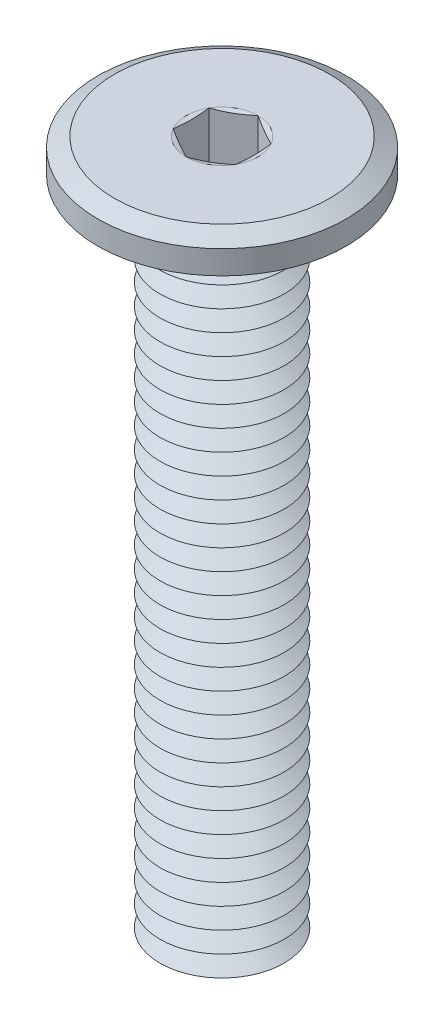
ISO-10303-21;
HEADER;
FILE_DESCRIPTION(('STEP AP214'),'2;1');
FILE_NAME('part.step','',(''),(''),'','','');
FILE_SCHEMA(('AUTOMOTIVE_DESIGN { 1 0 10303 214 1 1 1 1 }'));
ENDSEC;
DATA;
#1=APPLICATION_CONTEXT('core data for automotive mechanical design processes');
#2=APPLICATION_PROTOCOL_DEFINITION('international standard','automotive_design',2000,#1);
#3=PRODUCT_CONTEXT('',#1,'mechanical');
#4=PRODUCT('Part','Part','',(#3));
#5=PRODUCT_RELATED_PRODUCT_CATEGORY('part','',(#4));
#6=PRODUCT_DEFINITION_FORMATION('','',#4);
#7=PRODUCT_DEFINITION_CONTEXT('part definition',#1,'design');
#8=PRODUCT_DEFINITION('design','',#6,#7);
#9=PRODUCT_DEFINITION_SHAPE('','',#8);
#10=(LENGTH_UNIT() NAMED_UNIT(*) SI_UNIT(.MILLI.,.METRE.));
#11=(NAMED_UNIT(*) PLANE_ANGLE_UNIT() SI_UNIT($,.RADIAN.));
#12=(NAMED_UNIT(*) SI_UNIT($,.STERADIAN.) SOLID_ANGLE_UNIT());
#13=UNCERTAINTY_MEASURE_WITH_UNIT(LENGTH_MEASURE(1.E-05),#10,'distance_accuracy_value','');
#14=(GEOMETRIC_REPRESENTATION_CONTEXT(3) GLOBAL_UNCERTAINTY_ASSIGNED_CONTEXT((#13)) GLOBAL_UNIT_ASSIGNED_CONTEXT((#10,
#11,#12)) REPRESENTATION_CONTEXT('',''));
#15=CARTESIAN_POINT('',(0.,0.,0.));
#16=DIRECTION('',(0.,0.,1.));
#17=DIRECTION('',(1.,0.,0.));
#18=AXIS2_PLACEMENT_3D('',#15,#16,#17);
#19=CARTESIAN_POINT('',(0.,-16.05,0.));
#20=DIRECTION('',(0.,-1.,0.));
#21=DIRECTION('',(0.,0.,-1.));
#22=AXIS2_PLACEMENT_3D('',#19,#20,#21);
#23=CONICAL_SURFACE('',#22,1.5,1.0471975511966);
#24=CARTESIAN_POINT('',(0.,-15.8,0.));
#25=DIRECTION('',(0.,1.,0.));
#26=DIRECTION('',(0.,0.,1.));
#27=AXIS2_PLACEMENT_3D('',#24,#25,#26);
#28=CIRCLE('',#27,1.06698729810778);
#29=CARTESIAN_POINT('',(0.,-15.8,1.06698729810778));
#30=VERTEX_POINT('',#29);
#31=EDGE_CURVE('E603',#30,#30,#28,.T.);
#32=ORIENTED_EDGE('',*,*,#31,.F.);
#33=EDGE_LOOP('',(#32));
#34=FACE_BOUND('',#33,.T.);
#35=CARTESIAN_POINT('',(0.,-16.05,0.));
#36=DIRECTION('',(0.,1.,0.));
#37=DIRECTION('',(0.,0.,1.));
#38=AXIS2_PLACEMENT_3D('',#35,#36,#37);
#39=CIRCLE('',#38,1.5);
#40=CARTESIAN_POINT('',(0.,-16.05,1.5));
#41=VERTEX_POINT('',#40);
#42=EDGE_CURVE('E607',#41,#41,#39,.T.);
#43=ORIENTED_EDGE('',*,*,#42,.T.);
#44=EDGE_LOOP('',(#43));
#45=FACE_BOUND('',#44,.T.);
#46=ADVANCED_FACE('F39',(#34,#45),#23,.T.);
#47=CARTESIAN_POINT('',(0.,-15.8,0.));
#48=DIRECTION('',(0.,1.,0.));
#49=DIRECTION('',(0.,0.,1.));
#50=AXIS2_PLACEMENT_3D('',#47,#48,#49);
#51=CONICAL_SURFACE('',#50,1.06698729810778,1.0471975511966);
#52=CARTESIAN_POINT('',(0.,-15.55,0.));
#53=DIRECTION('',(0.,1.,0.));
#54=DIRECTION('',(0.,0.,1.));
#55=AXIS2_PLACEMENT_3D('',#52,#53,#54);
#56=CIRCLE('',#55,1.5);
#57=CARTESIAN_POINT('',(0.,-15.55,1.5));
#58=VERTEX_POINT('',#57);
#59=EDGE_CURVE('E599',#58,#58,#56,.T.);
#60=ORIENTED_EDGE('',*,*,#59,.F.);
#61=EDGE_LOOP('',(#60));
#62=FACE_BOUND('',#61,.T.);
#63=ORIENTED_EDGE('',*,*,#31,.T.);
#64=EDGE_LOOP('',(#63));
#65=FACE_BOUND('',#64,.T.);
#66=ADVANCED_FACE('F233',(#62,#65),#51,.T.);
#67=CARTESIAN_POINT('',(0.,-16.8,0.));
#68=DIRECTION('',(0.,-1.,0.));
#69=DIRECTION('',(0.,0.,-1.));
#70=AXIS2_PLACEMENT_3D('',#67,#68,#69);
#71=PLANE('',#70);
#72=CARTESIAN_POINT('',(0.,-16.8,0.));
#73=DIRECTION('',(0.,1.,0.));
#74=DIRECTION('',(0.,0.,1.));
#75=AXIS2_PLACEMENT_3D('',#72,#73,#74);
#76=CIRCLE('',#75,1.06698729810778);
#77=CARTESIAN_POINT('',(0.,-16.8,1.06698729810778));
#78=VERTEX_POINT('',#77);
#79=EDGE_CURVE('E299',#78,#78,#76,.T.);
#80=ORIENTED_EDGE('',*,*,#79,.F.);
#81=EDGE_LOOP('',(#80));
#82=FACE_BOUND('',#81,.T.);
#83=ADVANCED_FACE('F239',(#82),#71,.T.);
#84=CARTESIAN_POINT('',(0.,-16.8,0.));
#85=DIRECTION('',(0.,1.,0.));
#86=DIRECTION('',(0.,0.,1.));
#87=AXIS2_PLACEMENT_3D('',#84,#85,#86);
#88=CONICAL_SURFACE('',#87,1.06698729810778,1.0471975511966);
#89=CARTESIAN_POINT('',(0.,-16.55,0.));
#90=DIRECTION('',(0.,1.,0.));
#91=DIRECTION('',(0.,0.,1.));
#92=AXIS2_PLACEMENT_3D('',#89,#90,#91);
#93=CIRCLE('',#92,1.5);
#94=CARTESIAN_POINT('',(0.,-16.55,1.5));
#95=VERTEX_POINT('',#94);
#96=EDGE_CURVE('E614',#95,#95,#93,.T.);
#97=ORIENTED_EDGE('',*,*,#96,.F.);
#98=EDGE_LOOP('',(#97));
#99=FACE_BOUND('',#98,.T.);
#100=ORIENTED_EDGE('',*,*,#79,.T.);
#101=EDGE_LOOP('',(#100));
#102=FACE_BOUND('',#101,.T.);
#103=ADVANCED_FACE('F254',(#99,#102),#88,.T.);
#104=CARTESIAN_POINT('',(0.,-16.55,0.));
#105=DIRECTION('',(0.,-1.,0.));
#106=DIRECTION('',(0.,0.,-1.));
#107=AXIS2_PLACEMENT_3D('',#104,#105,#106);
#108=CONICAL_SURFACE('',#107,1.5,1.0471975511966);
#109=CARTESIAN_POINT('',(0.,-16.3,0.));
#110=DIRECTION('',(0.,1.,0.));
#111=DIRECTION('',(0.,0.,1.));
#112=AXIS2_PLACEMENT_3D('',#109,#110,#111);
#113=CIRCLE('',#112,1.06698729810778);
#114=CARTESIAN_POINT('',(0.,-16.3,1.06698729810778));
#115=VERTEX_POINT('',#114);
#116=EDGE_CURVE('E611',#115,#115,#113,.T.);
#117=ORIENTED_EDGE('',*,*,#116,.F.);
#118=EDGE_LOOP('',(#117));
#119=FACE_BOUND('',#118,.T.);
#120=ORIENTED_EDGE('',*,*,#96,.T.);
#121=EDGE_LOOP('',(#120));
#122=FACE_BOUND('',#121,.T.);
#123=ADVANCED_FACE('F250',(#119,#122),#108,.T.);
#124=CARTESIAN_POINT('',(0.,-16.3,0.));
#125=DIRECTION('',(0.,1.,0.));
#126=DIRECTION('',(0.,0.,1.));
#127=AXIS2_PLACEMENT_3D('',#124,#125,#126);
#128=CONICAL_SURFACE('',#127,1.06698729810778,1.0471975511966);
#129=ORIENTED_EDGE('',*,*,#42,.F.);
#130=EDGE_LOOP('',(#129));
#131=FACE_BOUND('',#130,.T.);
#132=ORIENTED_EDGE('',*,*,#116,.T.);
#133=EDGE_LOOP('',(#132));
#134=FACE_BOUND('',#133,.T.);
#135=ADVANCED_FACE('F246',(#131,#134),#128,.T.);
#136=CARTESIAN_POINT('',(0.,-15.55,0.));
#137=DIRECTION('',(0.,-1.,0.));
#138=DIRECTION('',(0.,0.,-1.));
#139=AXIS2_PLACEMENT_3D('',#136,#137,#138);
#140=CONICAL_SURFACE('',#139,1.5,1.0471975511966);
#141=CARTESIAN_POINT('',(0.,-15.3,0.));
#142=DIRECTION('',(0.,1.,0.));
#143=DIRECTION('',(0.,0.,1.));
#144=AXIS2_PLACEMENT_3D('',#141,#142,#143);
#145=CIRCLE('',#144,1.06698729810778);
#146=CARTESIAN_POINT('',(0.,-15.3,1.06698729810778));
#147=VERTEX_POINT('',#146);
#148=EDGE_CURVE('E596',#147,#147,#145,.T.);
#149=ORIENTED_EDGE('',*,*,#148,.F.);
#150=EDGE_LOOP('',(#149));
#151=FACE_BOUND('',#150,.T.);
#152=ORIENTED_EDGE('',*,*,#59,.T.);
#153=EDGE_LOOP('',(#152));
#154=FACE_BOUND('',#153,.T.);
#155=ADVANCED_FACE('F249',(#151,#154),#140,.T.);
#156=CARTESIAN_POINT('',(0.,-15.3,0.));
#157=DIRECTION('',(0.,1.,0.));
#158=DIRECTION('',(0.,0.,1.));
#159=AXIS2_PLACEMENT_3D('',#156,#157,#158);
#160=CONICAL_SURFACE('',#159,1.06698729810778,1.0471975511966);
#161=CARTESIAN_POINT('',(0.,-15.05,0.));
#162=DIRECTION('',(0.,1.,0.));
#163=DIRECTION('',(0.,0.,1.));
#164=AXIS2_PLACEMENT_3D('',#161,#162,#163);
#165=CIRCLE('',#164,1.5);
#166=CARTESIAN_POINT('',(0.,-15.05,1.5));
#167=VERTEX_POINT('',#166);
#168=EDGE_CURVE('E592',#167,#167,#165,.T.);
#169=ORIENTED_EDGE('',*,*,#168,.F.);
#170=EDGE_LOOP('',(#169));
#171=FACE_BOUND('',#170,.T.);
#172=ORIENTED_EDGE('',*,*,#148,.T.);
#173=EDGE_LOOP('',(#172));
#174=FACE_BOUND('',#173,.T.);
#175=ADVANCED_FACE('F1214',(#171,#174),#160,.T.);
#176=CARTESIAN_POINT('',(0.,-15.05,0.));
#177=DIRECTION('',(0.,-1.,0.));
#178=DIRECTION('',(0.,0.,-1.));
#179=AXIS2_PLACEMENT_3D('',#176,#177,#178);
#180=CONICAL_SURFACE('',#179,1.5,1.0471975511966);
#181=CARTESIAN_POINT('',(0.,-14.8,0.));
#182=DIRECTION('',(0.,1.,0.));
#183=DIRECTION('',(0.,0.,1.));
#184=AXIS2_PLACEMENT_3D('',#181,#182,#183);
#185=CIRCLE('',#184,1.06698729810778);
#186=CARTESIAN_POINT('',(0.,-14.8,1.06698729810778));
#187=VERTEX_POINT('',#186);
#188=EDGE_CURVE('E588',#187,#187,#185,.T.);
#189=ORIENTED_EDGE('',*,*,#188,.F.);
#190=EDGE_LOOP('',(#189));
#191=FACE_BOUND('',#190,.T.);
#192=ORIENTED_EDGE('',*,*,#168,.T.);
#193=EDGE_LOOP('',(#192));
#194=FACE_BOUND('',#193,.T.);
#195=ADVANCED_FACE('F1205',(#191,#194),#180,.T.);
#196=CARTESIAN_POINT('',(0.,-14.8,0.));
#197=DIRECTION('',(0.,1.,0.));
#198=DIRECTION('',(0.,0.,1.));
#199=AXIS2_PLACEMENT_3D('',#196,#197,#198);
#200=CONICAL_SURFACE('',#199,1.06698729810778,1.0471975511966);
#201=CARTESIAN_POINT('',(0.,-14.55,0.));
#202=DIRECTION('',(0.,1.,0.));
#203=DIRECTION('',(0.,0.,1.));
#204=AXIS2_PLACEMENT_3D('',#201,#202,#203);
#205=CIRCLE('',#204,1.5);
#206=CARTESIAN_POINT('',(0.,-14.55,1.5));
#207=VERTEX_POINT('',#206);
#208=EDGE_CURVE('E584',#207,#207,#205,.T.);
#209=ORIENTED_EDGE('',*,*,#208,.F.);
#210=EDGE_LOOP('',(#209));
#211=FACE_BOUND('',#210,.T.);
#212=ORIENTED_EDGE('',*,*,#188,.T.);
#213=EDGE_LOOP('',(#212));
#214=FACE_BOUND('',#213,.T.);
#215=ADVANCED_FACE('F1196',(#211,#214),#200,.T.);
#216=CARTESIAN_POINT('',(0.,-14.55,0.));
#217=DIRECTION('',(0.,-1.,0.));
#218=DIRECTION('',(0.,0.,-1.));
#219=AXIS2_PLACEMENT_3D('',#216,#217,#218);
#220=CONICAL_SURFACE('',#219,1.5,1.0471975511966);
#221=CARTESIAN_POINT('',(0.,-14.3,0.));
#222=DIRECTION('',(0.,1.,0.));
#223=DIRECTION('',(0.,0.,1.));
#224=AXIS2_PLACEMENT_3D('',#221,#222,#223);
#225=CIRCLE('',#224,1.06698729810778);
#226=CARTESIAN_POINT('',(0.,-14.3,1.06698729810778));
#227=VERTEX_POINT('',#226);
#228=EDGE_CURVE('E581',#227,#227,#225,.T.);
#229=ORIENTED_EDGE('',*,*,#228,.F.);
#230=EDGE_LOOP('',(#229));
#231=FACE_BOUND('',#230,.T.);
#232=ORIENTED_EDGE('',*,*,#208,.T.);
#233=EDGE_LOOP('',(#232));
#234=FACE_BOUND('',#233,.T.);
#235=ADVANCED_FACE('F1187',(#231,#234),#220,.T.);
#236=CARTESIAN_POINT('',(0.,-14.3,0.));
#237=DIRECTION('',(0.,1.,0.));
#238=DIRECTION('',(0.,0.,1.));
#239=AXIS2_PLACEMENT_3D('',#236,#237,#238);
#240=CONICAL_SURFACE('',#239,1.06698729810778,1.0471975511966);
#241=CARTESIAN_POINT('',(0.,-14.05,0.));
#242=DIRECTION('',(0.,1.,0.));
#243=DIRECTION('',(0.,0.,1.));
#244=AXIS2_PLACEMENT_3D('',#241,#242,#243);
#245=CIRCLE('',#244,1.5);
#246=CARTESIAN_POINT('',(0.,-14.05,1.5));
#247=VERTEX_POINT('',#246);
#248=EDGE_CURVE('E577',#247,#247,#245,.T.);
#249=ORIENTED_EDGE('',*,*,#248,.F.);
#250=EDGE_LOOP('',(#249));
#251=FACE_BOUND('',#250,.T.);
#252=ORIENTED_EDGE('',*,*,#228,.T.);
#253=EDGE_LOOP('',(#252));
#254=FACE_BOUND('',#253,.T.);
#255=ADVANCED_FACE('F1178',(#251,#254),#240,.T.);
#256=CARTESIAN_POINT('',(0.,-14.05,0.));
#257=DIRECTION('',(0.,-1.,0.));
#258=DIRECTION('',(0.,0.,-1.));
#259=AXIS2_PLACEMENT_3D('',#256,#257,#258);
#260=CONICAL_SURFACE('',#259,1.5,1.0471975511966);
#261=CARTESIAN_POINT('',(0.,-13.8,0.));
#262=DIRECTION('',(0.,1.,0.));
#263=DIRECTION('',(0.,0.,1.));
#264=AXIS2_PLACEMENT_3D('',#261,#262,#263);
#265=CIRCLE('',#264,1.06698729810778);
#266=CARTESIAN_POINT('',(0.,-13.8,1.06698729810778));
#267=VERTEX_POINT('',#266);
#268=EDGE_CURVE('E573',#267,#267,#265,.T.);
#269=ORIENTED_EDGE('',*,*,#268,.F.);
#270=EDGE_LOOP('',(#269));
#271=FACE_BOUND('',#270,.T.);
#272=ORIENTED_EDGE('',*,*,#248,.T.);
#273=EDGE_LOOP('',(#272));
#274=FACE_BOUND('',#273,.T.);
#275=ADVANCED_FACE('F1169',(#271,#274),#260,.T.);
#276=CARTESIAN_POINT('',(0.,-13.8,0.));
#277=DIRECTION('',(0.,1.,0.));
#278=DIRECTION('',(0.,0.,1.));
#279=AXIS2_PLACEMENT_3D('',#276,#277,#278);
#280=CONICAL_SURFACE('',#279,1.06698729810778,1.0471975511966);
#281=CARTESIAN_POINT('',(0.,-13.55,0.));
#282=DIRECTION('',(0.,1.,0.));
#283=DIRECTION('',(0.,0.,1.));
#284=AXIS2_PLACEMENT_3D('',#281,#282,#283);
#285=CIRCLE('',#284,1.5);
#286=CARTESIAN_POINT('',(0.,-13.55,1.5));
#287=VERTEX_POINT('',#286);
#288=EDGE_CURVE('E569',#287,#287,#285,.T.);
#289=ORIENTED_EDGE('',*,*,#288,.F.);
#290=EDGE_LOOP('',(#289));
#291=FACE_BOUND('',#290,.T.);
#292=ORIENTED_EDGE('',*,*,#268,.T.);
#293=EDGE_LOOP('',(#292));
#294=FACE_BOUND('',#293,.T.);
#295=ADVANCED_FACE('F1160',(#291,#294),#280,.T.);
#296=CARTESIAN_POINT('',(0.,-13.55,0.));
#297=DIRECTION('',(0.,-1.,0.));
#298=DIRECTION('',(0.,0.,-1.));
#299=AXIS2_PLACEMENT_3D('',#296,#297,#298);
#300=CONICAL_SURFACE('',#299,1.5,1.0471975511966);
#301=CARTESIAN_POINT('',(0.,-13.3,0.));
#302=DIRECTION('',(0.,1.,0.));
#303=DIRECTION('',(0.,0.,1.));
#304=AXIS2_PLACEMENT_3D('',#301,#302,#303);
#305=CIRCLE('',#304,1.06698729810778);
#306=CARTESIAN_POINT('',(0.,-13.3,1.06698729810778));
#307=VERTEX_POINT('',#306);
#308=EDGE_CURVE('E565',#307,#307,#305,.T.);
#309=ORIENTED_EDGE('',*,*,#308,.F.);
#310=EDGE_LOOP('',(#309));
#311=FACE_BOUND('',#310,.T.);
#312=ORIENTED_EDGE('',*,*,#288,.T.);
#313=EDGE_LOOP('',(#312));
#314=FACE_BOUND('',#313,.T.);
#315=ADVANCED_FACE('F1151',(#311,#314),#300,.T.);
#316=CARTESIAN_POINT('',(0.,-13.3,0.));
#317=DIRECTION('',(0.,1.,0.));
#318=DIRECTION('',(0.,0.,1.));
#319=AXIS2_PLACEMENT_3D('',#316,#317,#318);
#320=CONICAL_SURFACE('',#319,1.06698729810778,1.0471975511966);
#321=CARTESIAN_POINT('',(0.,-13.05,0.));
#322=DIRECTION('',(0.,1.,0.));
#323=DIRECTION('',(0.,0.,1.));
#324=AXIS2_PLACEMENT_3D('',#321,#322,#323);
#325=CIRCLE('',#324,1.5);
#326=CARTESIAN_POINT('',(0.,-13.05,1.5));
#327=VERTEX_POINT('',#326);
#328=EDGE_CURVE('E561',#327,#327,#325,.T.);
#329=ORIENTED_EDGE('',*,*,#328,.F.);
#330=EDGE_LOOP('',(#329));
#331=FACE_BOUND('',#330,.T.);
#332=ORIENTED_EDGE('',*,*,#308,.T.);
#333=EDGE_LOOP('',(#332));
#334=FACE_BOUND('',#333,.T.);
#335=ADVANCED_FACE('F1142',(#331,#334),#320,.T.);
#336=CARTESIAN_POINT('',(0.,-13.05,0.));
#337=DIRECTION('',(0.,-1.,0.));
#338=DIRECTION('',(0.,0.,-1.));
#339=AXIS2_PLACEMENT_3D('',#336,#337,#338);
#340=CONICAL_SURFACE('',#339,1.5,1.0471975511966);
#341=CARTESIAN_POINT('',(0.,-12.8,0.));
#342=DIRECTION('',(0.,1.,0.));
#343=DIRECTION('',(0.,0.,1.));
#344=AXIS2_PLACEMENT_3D('',#341,#342,#343);
#345=CIRCLE('',#344,1.06698729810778);
#346=CARTESIAN_POINT('',(0.,-12.8,1.06698729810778));
#347=VERTEX_POINT('',#346);
#348=EDGE_CURVE('E557',#347,#347,#345,.T.);
#349=ORIENTED_EDGE('',*,*,#348,.F.);
#350=EDGE_LOOP('',(#349));
#351=FACE_BOUND('',#350,.T.);
#352=ORIENTED_EDGE('',*,*,#328,.T.);
#353=EDGE_LOOP('',(#352));
#354=FACE_BOUND('',#353,.T.);
#355=ADVANCED_FACE('F1133',(#351,#354),#340,.T.);
#356=CARTESIAN_POINT('',(0.,-12.8,0.));
#357=DIRECTION('',(0.,1.,0.));
#358=DIRECTION('',(0.,0.,1.));
#359=AXIS2_PLACEMENT_3D('',#356,#357,#358);
#360=CONICAL_SURFACE('',#359,1.06698729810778,1.0471975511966);
#361=CARTESIAN_POINT('',(0.,-12.55,0.));
#362=DIRECTION('',(0.,1.,0.));
#363=DIRECTION('',(0.,0.,1.));
#364=AXIS2_PLACEMENT_3D('',#361,#362,#363);
#365=CIRCLE('',#364,1.5);
#366=CARTESIAN_POINT('',(0.,-12.55,1.5));
#367=VERTEX_POINT('',#366);
#368=EDGE_CURVE('E553',#367,#367,#365,.T.);
#369=ORIENTED_EDGE('',*,*,#368,.F.);
#370=EDGE_LOOP('',(#369));
#371=FACE_BOUND('',#370,.T.);
#372=ORIENTED_EDGE('',*,*,#348,.T.);
#373=EDGE_LOOP('',(#372));
#374=FACE_BOUND('',#373,.T.);
#375=ADVANCED_FACE('F1124',(#371,#374),#360,.T.);
#376=CARTESIAN_POINT('',(0.,-12.55,0.));
#377=DIRECTION('',(0.,-1.,0.));
#378=DIRECTION('',(0.,0.,-1.));
#379=AXIS2_PLACEMENT_3D('',#376,#377,#378);
#380=CONICAL_SURFACE('',#379,1.5,1.0471975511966);
#381=CARTESIAN_POINT('',(0.,-12.3,0.));
#382=DIRECTION('',(0.,1.,0.));
#383=DIRECTION('',(0.,0.,1.));
#384=AXIS2_PLACEMENT_3D('',#381,#382,#383);
#385=CIRCLE('',#384,1.06698729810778);
#386=CARTESIAN_POINT('',(0.,-12.3,1.06698729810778));
#387=VERTEX_POINT('',#386);
#388=EDGE_CURVE('E549',#387,#387,#385,.T.);
#389=ORIENTED_EDGE('',*,*,#388,.F.);
#390=EDGE_LOOP('',(#389));
#391=FACE_BOUND('',#390,.T.);
#392=ORIENTED_EDGE('',*,*,#368,.T.);
#393=EDGE_LOOP('',(#392));
#394=FACE_BOUND('',#393,.T.);
#395=ADVANCED_FACE('F1115',(#391,#394),#380,.T.);
#396=CARTESIAN_POINT('',(0.,-12.3,0.));
#397=DIRECTION('',(0.,1.,0.));
#398=DIRECTION('',(0.,0.,1.));
#399=AXIS2_PLACEMENT_3D('',#396,#397,#398);
#400=CONICAL_SURFACE('',#399,1.06698729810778,1.0471975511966);
#401=CARTESIAN_POINT('',(0.,-12.05,0.));
#402=DIRECTION('',(0.,1.,0.));
#403=DIRECTION('',(0.,0.,1.));
#404=AXIS2_PLACEMENT_3D('',#401,#402,#403);
#405=CIRCLE('',#404,1.5);
#406=CARTESIAN_POINT('',(0.,-12.05,1.5));
#407=VERTEX_POINT('',#406);
#408=EDGE_CURVE('E545',#407,#407,#405,.T.);
#409=ORIENTED_EDGE('',*,*,#408,.F.);
#410=EDGE_LOOP('',(#409));
#411=FACE_BOUND('',#410,.T.);
#412=ORIENTED_EDGE('',*,*,#388,.T.);
#413=EDGE_LOOP('',(#412));
#414=FACE_BOUND('',#413,.T.);
#415=ADVANCED_FACE('F1106',(#411,#414),#400,.T.);
#416=CARTESIAN_POINT('',(0.,-12.05,0.));
#417=DIRECTION('',(0.,-1.,0.));
#418=DIRECTION('',(0.,0.,-1.));
#419=AXIS2_PLACEMENT_3D('',#416,#417,#418);
#420=CONICAL_SURFACE('',#419,1.5,1.0471975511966);
#421=CARTESIAN_POINT('',(0.,-11.8,0.));
#422=DIRECTION('',(0.,1.,0.));
#423=DIRECTION('',(0.,0.,1.));
#424=AXIS2_PLACEMENT_3D('',#421,#422,#423);
#425=CIRCLE('',#424,1.06698729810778);
#426=CARTESIAN_POINT('',(0.,-11.8,1.06698729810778));
#427=VERTEX_POINT('',#426);
#428=EDGE_CURVE('E541',#427,#427,#425,.T.);
#429=ORIENTED_EDGE('',*,*,#428,.F.);
#430=EDGE_LOOP('',(#429));
#431=FACE_BOUND('',#430,.T.);
#432=ORIENTED_EDGE('',*,*,#408,.T.);
#433=EDGE_LOOP('',(#432));
#434=FACE_BOUND('',#433,.T.);
#435=ADVANCED_FACE('F1097',(#431,#434),#420,.T.);
#436=CARTESIAN_POINT('',(0.,-11.8,0.));
#437=DIRECTION('',(0.,1.,0.));
#438=DIRECTION('',(0.,0.,1.));
#439=AXIS2_PLACEMENT_3D('',#436,#437,#438);
#440=CONICAL_SURFACE('',#439,1.06698729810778,1.0471975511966);
#441=CARTESIAN_POINT('',(0.,-11.55,0.));
#442=DIRECTION('',(0.,1.,0.));
#443=DIRECTION('',(0.,0.,1.));
#444=AXIS2_PLACEMENT_3D('',#441,#442,#443);
#445=CIRCLE('',#444,1.5);
#446=CARTESIAN_POINT('',(0.,-11.55,1.5));
#447=VERTEX_POINT('',#446);
#448=EDGE_CURVE('E537',#447,#447,#445,.T.);
#449=ORIENTED_EDGE('',*,*,#448,.F.);
#450=EDGE_LOOP('',(#449));
#451=FACE_BOUND('',#450,.T.);
#452=ORIENTED_EDGE('',*,*,#428,.T.);
#453=EDGE_LOOP('',(#452));
#454=FACE_BOUND('',#453,.T.);
#455=ADVANCED_FACE('F1088',(#451,#454),#440,.T.);
#456=CARTESIAN_POINT('',(0.,-11.55,0.));
#457=DIRECTION('',(0.,-1.,0.));
#458=DIRECTION('',(0.,0.,-1.));
#459=AXIS2_PLACEMENT_3D('',#456,#457,#458);
#460=CONICAL_SURFACE('',#459,1.5,1.0471975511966);
#461=CARTESIAN_POINT('',(0.,-11.3,0.));
#462=DIRECTION('',(0.,1.,0.));
#463=DIRECTION('',(0.,0.,1.));
#464=AXIS2_PLACEMENT_3D('',#461,#462,#463);
#465=CIRCLE('',#464,1.06698729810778);
#466=CARTESIAN_POINT('',(0.,-11.3,1.06698729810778));
#467=VERTEX_POINT('',#466);
#468=EDGE_CURVE('E533',#467,#467,#465,.T.);
#469=ORIENTED_EDGE('',*,*,#468,.F.);
#470=EDGE_LOOP('',(#469));
#471=FACE_BOUND('',#470,.T.);
#472=ORIENTED_EDGE('',*,*,#448,.T.);
#473=EDGE_LOOP('',(#472));
#474=FACE_BOUND('',#473,.T.);
#475=ADVANCED_FACE('F1079',(#471,#474),#460,.T.);
#476=CARTESIAN_POINT('',(0.,-11.3,0.));
#477=DIRECTION('',(0.,1.,0.));
#478=DIRECTION('',(0.,0.,1.));
#479=AXIS2_PLACEMENT_3D('',#476,#477,#478);
#480=CONICAL_SURFACE('',#479,1.06698729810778,1.0471975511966);
#481=CARTESIAN_POINT('',(0.,-11.05,0.));
#482=DIRECTION('',(0.,1.,0.));
#483=DIRECTION('',(0.,0.,1.));
#484=AXIS2_PLACEMENT_3D('',#481,#482,#483);
#485=CIRCLE('',#484,1.5);
#486=CARTESIAN_POINT('',(0.,-11.05,1.5));
#487=VERTEX_POINT('',#486);
#488=EDGE_CURVE('E529',#487,#487,#485,.T.);
#489=ORIENTED_EDGE('',*,*,#488,.F.);
#490=EDGE_LOOP('',(#489));
#491=FACE_BOUND('',#490,.T.);
#492=ORIENTED_EDGE('',*,*,#468,.T.);
#493=EDGE_LOOP('',(#492));
#494=FACE_BOUND('',#493,.T.);
#495=ADVANCED_FACE('F1070',(#491,#494),#480,.T.);
#496=CARTESIAN_POINT('',(0.,-11.05,0.));
#497=DIRECTION('',(0.,-1.,0.));
#498=DIRECTION('',(0.,0.,-1.));
#499=AXIS2_PLACEMENT_3D('',#496,#497,#498);
#500=CONICAL_SURFACE('',#499,1.5,1.0471975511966);
#501=CARTESIAN_POINT('',(0.,-10.8,0.));
#502=DIRECTION('',(0.,1.,0.));
#503=DIRECTION('',(0.,0.,1.));
#504=AXIS2_PLACEMENT_3D('',#501,#502,#503);
#505=CIRCLE('',#504,1.06698729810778);
#506=CARTESIAN_POINT('',(0.,-10.8,1.06698729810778));
#507=VERTEX_POINT('',#506);
#508=EDGE_CURVE('E525',#507,#507,#505,.T.);
#509=ORIENTED_EDGE('',*,*,#508,.F.);
#510=EDGE_LOOP('',(#509));
#511=FACE_BOUND('',#510,.T.);
#512=ORIENTED_EDGE('',*,*,#488,.T.);
#513=EDGE_LOOP('',(#512));
#514=FACE_BOUND('',#513,.T.);
#515=ADVANCED_FACE('F1061',(#511,#514),#500,.T.);
#516=CARTESIAN_POINT('',(0.,-10.8,0.));
#517=DIRECTION('',(0.,1.,0.));
#518=DIRECTION('',(0.,0.,1.));
#519=AXIS2_PLACEMENT_3D('',#516,#517,#518);
#520=CONICAL_SURFACE('',#519,1.06698729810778,1.0471975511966);
#521=CARTESIAN_POINT('',(0.,-10.55,0.));
#522=DIRECTION('',(0.,1.,0.));
#523=DIRECTION('',(0.,0.,1.));
#524=AXIS2_PLACEMENT_3D('',#521,#522,#523);
#525=CIRCLE('',#524,1.5);
#526=CARTESIAN_POINT('',(0.,-10.55,1.5));
#527=VERTEX_POINT('',#526);
#528=EDGE_CURVE('E521',#527,#527,#525,.T.);
#529=ORIENTED_EDGE('',*,*,#528,.F.);
#530=EDGE_LOOP('',(#529));
#531=FACE_BOUND('',#530,.T.);
#532=ORIENTED_EDGE('',*,*,#508,.T.);
#533=EDGE_LOOP('',(#532));
#534=FACE_BOUND('',#533,.T.);
#535=ADVANCED_FACE('F1052',(#531,#534),#520,.T.);
#536=CARTESIAN_POINT('',(0.,-10.55,0.));
#537=DIRECTION('',(0.,-1.,0.));
#538=DIRECTION('',(0.,0.,-1.));
#539=AXIS2_PLACEMENT_3D('',#536,#537,#538);
#540=CONICAL_SURFACE('',#539,1.5,1.0471975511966);
#541=CARTESIAN_POINT('',(0.,-10.3,0.));
#542=DIRECTION('',(0.,1.,0.));
#543=DIRECTION('',(0.,0.,1.));
#544=AXIS2_PLACEMENT_3D('',#541,#542,#543);
#545=CIRCLE('',#544,1.06698729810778);
#546=CARTESIAN_POINT('',(0.,-10.3,1.06698729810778));
#547=VERTEX_POINT('',#546);
#548=EDGE_CURVE('E517',#547,#547,#545,.T.);
#549=ORIENTED_EDGE('',*,*,#548,.F.);
#550=EDGE_LOOP('',(#549));
#551=FACE_BOUND('',#550,.T.);
#552=ORIENTED_EDGE('',*,*,#528,.T.);
#553=EDGE_LOOP('',(#552));
#554=FACE_BOUND('',#553,.T.);
#555=ADVANCED_FACE('F1043',(#551,#554),#540,.T.);
#556=CARTESIAN_POINT('',(0.,-10.3,0.));
#557=DIRECTION('',(0.,1.,0.));
#558=DIRECTION('',(0.,0.,1.));
#559=AXIS2_PLACEMENT_3D('',#556,#557,#558);
#560=CONICAL_SURFACE('',#559,1.06698729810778,1.0471975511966);
#561=CARTESIAN_POINT('',(0.,-10.05,0.));
#562=DIRECTION('',(0.,1.,0.));
#563=DIRECTION('',(0.,0.,1.));
#564=AXIS2_PLACEMENT_3D('',#561,#562,#563);
#565=CIRCLE('',#564,1.5);
#566=CARTESIAN_POINT('',(0.,-10.05,1.5));
#567=VERTEX_POINT('',#566);
#568=EDGE_CURVE('E513',#567,#567,#565,.T.);
#569=ORIENTED_EDGE('',*,*,#568,.F.);
#570=EDGE_LOOP('',(#569));
#571=FACE_BOUND('',#570,.T.);
#572=ORIENTED_EDGE('',*,*,#548,.T.);
#573=EDGE_LOOP('',(#572));
#574=FACE_BOUND('',#573,.T.);
#575=ADVANCED_FACE('F1034',(#571,#574),#560,.T.);
#576=CARTESIAN_POINT('',(0.,-10.05,0.));
#577=DIRECTION('',(0.,-1.,0.));
#578=DIRECTION('',(0.,0.,-1.));
#579=AXIS2_PLACEMENT_3D('',#576,#577,#578);
#580=CONICAL_SURFACE('',#579,1.5,1.0471975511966);
#581=CARTESIAN_POINT('',(0.,-9.8,0.));
#582=DIRECTION('',(0.,1.,0.));
#583=DIRECTION('',(0.,0.,1.));
#584=AXIS2_PLACEMENT_3D('',#581,#582,#583);
#585=CIRCLE('',#584,1.06698729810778);
#586=CARTESIAN_POINT('',(0.,-9.8,1.06698729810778));
#587=VERTEX_POINT('',#586);
#588=EDGE_CURVE('E509',#587,#587,#585,.T.);
#589=ORIENTED_EDGE('',*,*,#588,.F.);
#590=EDGE_LOOP('',(#589));
#591=FACE_BOUND('',#590,.T.);
#592=ORIENTED_EDGE('',*,*,#568,.T.);
#593=EDGE_LOOP('',(#592));
#594=FACE_BOUND('',#593,.T.);
#595=ADVANCED_FACE('F1025',(#591,#594),#580,.T.);
#596=CARTESIAN_POINT('',(0.,-9.8,0.));
#597=DIRECTION('',(0.,1.,0.));
#598=DIRECTION('',(0.,0.,1.));
#599=AXIS2_PLACEMENT_3D('',#596,#597,#598);
#600=CONICAL_SURFACE('',#599,1.06698729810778,1.0471975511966);
#601=CARTESIAN_POINT('',(0.,-9.55,0.));
#602=DIRECTION('',(0.,1.,0.));
#603=DIRECTION('',(0.,0.,1.));
#604=AXIS2_PLACEMENT_3D('',#601,#602,#603);
#605=CIRCLE('',#604,1.5);
#606=CARTESIAN_POINT('',(0.,-9.55,1.5));
#607=VERTEX_POINT('',#606);
#608=EDGE_CURVE('E505',#607,#607,#605,.T.);
#609=ORIENTED_EDGE('',*,*,#608,.F.);
#610=EDGE_LOOP('',(#609));
#611=FACE_BOUND('',#610,.T.);
#612=ORIENTED_EDGE('',*,*,#588,.T.);
#613=EDGE_LOOP('',(#612));
#614=FACE_BOUND('',#613,.T.);
#615=ADVANCED_FACE('F1016',(#611,#614),#600,.T.);
#616=CARTESIAN_POINT('',(0.,-9.55,0.));
#617=DIRECTION('',(0.,-1.,0.));
#618=DIRECTION('',(0.,0.,-1.));
#619=AXIS2_PLACEMENT_3D('',#616,#617,#618);
#620=CONICAL_SURFACE('',#619,1.5,1.0471975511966);
#621=CARTESIAN_POINT('',(0.,-9.3,0.));
#622=DIRECTION('',(0.,1.,0.));
#623=DIRECTION('',(0.,0.,1.));
#624=AXIS2_PLACEMENT_3D('',#621,#622,#623);
#625=CIRCLE('',#624,1.06698729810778);
#626=CARTESIAN_POINT('',(0.,-9.3,1.06698729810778));
#627=VERTEX_POINT('',#626);
#628=EDGE_CURVE('E501',#627,#627,#625,.T.);
#629=ORIENTED_EDGE('',*,*,#628,.F.);
#630=EDGE_LOOP('',(#629));
#631=FACE_BOUND('',#630,.T.);
#632=ORIENTED_EDGE('',*,*,#608,.T.);
#633=EDGE_LOOP('',(#632));
#634=FACE_BOUND('',#633,.T.);
#635=ADVANCED_FACE('F1007',(#631,#634),#620,.T.);
#636=CARTESIAN_POINT('',(0.,-9.3,0.));
#637=DIRECTION('',(0.,1.,0.));
#638=DIRECTION('',(0.,0.,1.));
#639=AXIS2_PLACEMENT_3D('',#636,#637,#638);
#640=CONICAL_SURFACE('',#639,1.06698729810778,1.0471975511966);
#641=CARTESIAN_POINT('',(0.,-9.05,0.));
#642=DIRECTION('',(0.,1.,0.));
#643=DIRECTION('',(0.,0.,1.));
#644=AXIS2_PLACEMENT_3D('',#641,#642,#643);
#645=CIRCLE('',#644,1.5);
#646=CARTESIAN_POINT('',(0.,-9.05,1.5));
#647=VERTEX_POINT('',#646);
#648=EDGE_CURVE('E497',#647,#647,#645,.T.);
#649=ORIENTED_EDGE('',*,*,#648,.F.);
#650=EDGE_LOOP('',(#649));
#651=FACE_BOUND('',#650,.T.);
#652=ORIENTED_EDGE('',*,*,#628,.T.);
#653=EDGE_LOOP('',(#652));
#654=FACE_BOUND('',#653,.T.);
#655=ADVANCED_FACE('F998',(#651,#654),#640,.T.);
#656=CARTESIAN_POINT('',(0.,-9.05,0.));
#657=DIRECTION('',(0.,-1.,0.));
#658=DIRECTION('',(0.,0.,-1.));
#659=AXIS2_PLACEMENT_3D('',#656,#657,#658);
#660=CONICAL_SURFACE('',#659,1.5,1.0471975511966);
#661=CARTESIAN_POINT('',(0.,-8.8,0.));
#662=DIRECTION('',(0.,1.,0.));
#663=DIRECTION('',(0.,0.,1.));
#664=AXIS2_PLACEMENT_3D('',#661,#662,#663);
#665=CIRCLE('',#664,1.06698729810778);
#666=CARTESIAN_POINT('',(0.,-8.8,1.06698729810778));
#667=VERTEX_POINT('',#666);
#668=EDGE_CURVE('E493',#667,#667,#665,.T.);
#669=ORIENTED_EDGE('',*,*,#668,.F.);
#670=EDGE_LOOP('',(#669));
#671=FACE_BOUND('',#670,.T.);
#672=ORIENTED_EDGE('',*,*,#648,.T.);
#673=EDGE_LOOP('',(#672));
#674=FACE_BOUND('',#673,.T.);
#675=ADVANCED_FACE('F989',(#671,#674),#660,.T.);
#676=CARTESIAN_POINT('',(0.,-8.8,0.));
#677=DIRECTION('',(0.,1.,0.));
#678=DIRECTION('',(0.,0.,1.));
#679=AXIS2_PLACEMENT_3D('',#676,#677,#678);
#680=CONICAL_SURFACE('',#679,1.06698729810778,1.0471975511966);
#681=CARTESIAN_POINT('',(0.,-8.55,0.));
#682=DIRECTION('',(0.,1.,0.));
#683=DIRECTION('',(0.,0.,1.));
#684=AXIS2_PLACEMENT_3D('',#681,#682,#683);
#685=CIRCLE('',#684,1.5);
#686=CARTESIAN_POINT('',(0.,-8.55,1.5));
#687=VERTEX_POINT('',#686);
#688=EDGE_CURVE('E489',#687,#687,#685,.T.);
#689=ORIENTED_EDGE('',*,*,#688,.F.);
#690=EDGE_LOOP('',(#689));
#691=FACE_BOUND('',#690,.T.);
#692=ORIENTED_EDGE('',*,*,#668,.T.);
#693=EDGE_LOOP('',(#692));
#694=FACE_BOUND('',#693,.T.);
#695=ADVANCED_FACE('F980',(#691,#694),#680,.T.);
#696=CARTESIAN_POINT('',(0.,-8.55,0.));
#697=DIRECTION('',(0.,-1.,0.));
#698=DIRECTION('',(0.,0.,-1.));
#699=AXIS2_PLACEMENT_3D('',#696,#697,#698);
#700=CONICAL_SURFACE('',#699,1.5,1.0471975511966);
#701=CARTESIAN_POINT('',(0.,-8.3,0.));
#702=DIRECTION('',(0.,1.,0.));
#703=DIRECTION('',(0.,0.,1.));
#704=AXIS2_PLACEMENT_3D('',#701,#702,#703);
#705=CIRCLE('',#704,1.06698729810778);
#706=CARTESIAN_POINT('',(0.,-8.3,1.06698729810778));
#707=VERTEX_POINT('',#706);
#708=EDGE_CURVE('E485',#707,#707,#705,.T.);
#709=ORIENTED_EDGE('',*,*,#708,.F.);
#710=EDGE_LOOP('',(#709));
#711=FACE_BOUND('',#710,.T.);
#712=ORIENTED_EDGE('',*,*,#688,.T.);
#713=EDGE_LOOP('',(#712));
#714=FACE_BOUND('',#713,.T.);
#715=ADVANCED_FACE('F971',(#711,#714),#700,.T.);
#716=CARTESIAN_POINT('',(0.,-8.3,0.));
#717=DIRECTION('',(0.,1.,0.));
#718=DIRECTION('',(0.,0.,1.));
#719=AXIS2_PLACEMENT_3D('',#716,#717,#718);
#720=CONICAL_SURFACE('',#719,1.06698729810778,1.0471975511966);
#721=CARTESIAN_POINT('',(0.,-8.05,0.));
#722=DIRECTION('',(0.,1.,0.));
#723=DIRECTION('',(0.,0.,1.));
#724=AXIS2_PLACEMENT_3D('',#721,#722,#723);
#725=CIRCLE('',#724,1.5);
#726=CARTESIAN_POINT('',(0.,-8.05,1.5));
#727=VERTEX_POINT('',#726);
#728=EDGE_CURVE('E481',#727,#727,#725,.T.);
#729=ORIENTED_EDGE('',*,*,#728,.F.);
#730=EDGE_LOOP('',(#729));
#731=FACE_BOUND('',#730,.T.);
#732=ORIENTED_EDGE('',*,*,#708,.T.);
#733=EDGE_LOOP('',(#732));
#734=FACE_BOUND('',#733,.T.);
#735=ADVANCED_FACE('F962',(#731,#734),#720,.T.);
#736=CARTESIAN_POINT('',(0.,-8.05,0.));
#737=DIRECTION('',(0.,-1.,0.));
#738=DIRECTION('',(0.,0.,-1.));
#739=AXIS2_PLACEMENT_3D('',#736,#737,#738);
#740=CONICAL_SURFACE('',#739,1.5,1.0471975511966);
#741=CARTESIAN_POINT('',(0.,-7.8,0.));
#742=DIRECTION('',(0.,1.,0.));
#743=DIRECTION('',(0.,0.,1.));
#744=AXIS2_PLACEMENT_3D('',#741,#742,#743);
#745=CIRCLE('',#744,1.06698729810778);
#746=CARTESIAN_POINT('',(0.,-7.8,1.06698729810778));
#747=VERTEX_POINT('',#746);
#748=EDGE_CURVE('E477',#747,#747,#745,.T.);
#749=ORIENTED_EDGE('',*,*,#748,.F.);
#750=EDGE_LOOP('',(#749));
#751=FACE_BOUND('',#750,.T.);
#752=ORIENTED_EDGE('',*,*,#728,.T.);
#753=EDGE_LOOP('',(#752));
#754=FACE_BOUND('',#753,.T.);
#755=ADVANCED_FACE('F953',(#751,#754),#740,.T.);
#756=CARTESIAN_POINT('',(0.,-7.8,0.));
#757=DIRECTION('',(0.,1.,0.));
#758=DIRECTION('',(0.,0.,1.));
#759=AXIS2_PLACEMENT_3D('',#756,#757,#758);
#760=CONICAL_SURFACE('',#759,1.06698729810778,1.0471975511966);
#761=CARTESIAN_POINT('',(0.,-7.55,0.));
#762=DIRECTION('',(0.,1.,0.));
#763=DIRECTION('',(0.,0.,1.));
#764=AXIS2_PLACEMENT_3D('',#761,#762,#763);
#765=CIRCLE('',#764,1.5);
#766=CARTESIAN_POINT('',(0.,-7.55,1.5));
#767=VERTEX_POINT('',#766);
#768=EDGE_CURVE('E473',#767,#767,#765,.T.);
#769=ORIENTED_EDGE('',*,*,#768,.F.);
#770=EDGE_LOOP('',(#769));
#771=FACE_BOUND('',#770,.T.);
#772=ORIENTED_EDGE('',*,*,#748,.T.);
#773=EDGE_LOOP('',(#772));
#774=FACE_BOUND('',#773,.T.);
#775=ADVANCED_FACE('F944',(#771,#774),#760,.T.);
#776=CARTESIAN_POINT('',(0.,-7.55,0.));
#777=DIRECTION('',(0.,-1.,0.));
#778=DIRECTION('',(0.,0.,-1.));
#779=AXIS2_PLACEMENT_3D('',#776,#777,#778);
#780=CONICAL_SURFACE('',#779,1.5,1.0471975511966);
#781=CARTESIAN_POINT('',(0.,-7.3,0.));
#782=DIRECTION('',(0.,1.,0.));
#783=DIRECTION('',(0.,0.,1.));
#784=AXIS2_PLACEMENT_3D('',#781,#782,#783);
#785=CIRCLE('',#784,1.06698729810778);
#786=CARTESIAN_POINT('',(0.,-7.3,1.06698729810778));
#787=VERTEX_POINT('',#786);
#788=EDGE_CURVE('E469',#787,#787,#785,.T.);
#789=ORIENTED_EDGE('',*,*,#788,.F.);
#790=EDGE_LOOP('',(#789));
#791=FACE_BOUND('',#790,.T.);
#792=ORIENTED_EDGE('',*,*,#768,.T.);
#793=EDGE_LOOP('',(#792));
#794=FACE_BOUND('',#793,.T.);
#795=ADVANCED_FACE('F935',(#791,#794),#780,.T.);
#796=CARTESIAN_POINT('',(0.,-7.3,0.));
#797=DIRECTION('',(0.,1.,0.));
#798=DIRECTION('',(0.,0.,1.));
#799=AXIS2_PLACEMENT_3D('',#796,#797,#798);
#800=CONICAL_SURFACE('',#799,1.06698729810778,1.0471975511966);
#801=CARTESIAN_POINT('',(0.,-7.05,0.));
#802=DIRECTION('',(0.,1.,0.));
#803=DIRECTION('',(0.,0.,1.));
#804=AXIS2_PLACEMENT_3D('',#801,#802,#803);
#805=CIRCLE('',#804,1.5);
#806=CARTESIAN_POINT('',(0.,-7.05,1.5));
#807=VERTEX_POINT('',#806);
#808=EDGE_CURVE('E466',#807,#807,#805,.T.);
#809=ORIENTED_EDGE('',*,*,#808,.F.);
#810=EDGE_LOOP('',(#809));
#811=FACE_BOUND('',#810,.T.);
#812=ORIENTED_EDGE('',*,*,#788,.T.);
#813=EDGE_LOOP('',(#812));
#814=FACE_BOUND('',#813,.T.);
#815=ADVANCED_FACE('F926',(#811,#814),#800,.T.);
#816=CARTESIAN_POINT('',(0.,-7.05,0.));
#817=DIRECTION('',(0.,-1.,0.));
#818=DIRECTION('',(0.,0.,-1.));
#819=AXIS2_PLACEMENT_3D('',#816,#817,#818);
#820=CONICAL_SURFACE('',#819,1.5,1.0471975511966);
#821=CARTESIAN_POINT('',(0.,-6.8,0.));
#822=DIRECTION('',(0.,1.,0.));
#823=DIRECTION('',(0.,0.,1.));
#824=AXIS2_PLACEMENT_3D('',#821,#822,#823);
#825=CIRCLE('',#824,1.06698729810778);
#826=CARTESIAN_POINT('',(0.,-6.8,1.06698729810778));
#827=VERTEX_POINT('',#826);
#828=EDGE_CURVE('E462',#827,#827,#825,.T.);
#829=ORIENTED_EDGE('',*,*,#828,.F.);
#830=EDGE_LOOP('',(#829));
#831=FACE_BOUND('',#830,.T.);
#832=ORIENTED_EDGE('',*,*,#808,.T.);
#833=EDGE_LOOP('',(#832));
#834=FACE_BOUND('',#833,.T.);
#835=ADVANCED_FACE('F917',(#831,#834),#820,.T.);
#836=CARTESIAN_POINT('',(0.,-6.8,0.));
#837=DIRECTION('',(0.,1.,0.));
#838=DIRECTION('',(0.,0.,1.));
#839=AXIS2_PLACEMENT_3D('',#836,#837,#838);
#840=CONICAL_SURFACE('',#839,1.06698729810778,1.0471975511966);
#841=CARTESIAN_POINT('',(0.,-6.55,0.));
#842=DIRECTION('',(0.,1.,0.));
#843=DIRECTION('',(0.,0.,1.));
#844=AXIS2_PLACEMENT_3D('',#841,#842,#843);
#845=CIRCLE('',#844,1.5);
#846=CARTESIAN_POINT('',(0.,-6.55,1.5));
#847=VERTEX_POINT('',#846);
#848=EDGE_CURVE('E458',#847,#847,#845,.T.);
#849=ORIENTED_EDGE('',*,*,#848,.F.);
#850=EDGE_LOOP('',(#849));
#851=FACE_BOUND('',#850,.T.);
#852=ORIENTED_EDGE('',*,*,#828,.T.);
#853=EDGE_LOOP('',(#852));
#854=FACE_BOUND('',#853,.T.);
#855=ADVANCED_FACE('F908',(#851,#854),#840,.T.);
#856=CARTESIAN_POINT('',(0.,-6.55,0.));
#857=DIRECTION('',(0.,-1.,0.));
#858=DIRECTION('',(0.,0.,-1.));
#859=AXIS2_PLACEMENT_3D('',#856,#857,#858);
#860=CONICAL_SURFACE('',#859,1.5,1.0471975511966);
#861=CARTESIAN_POINT('',(0.,-6.3,0.));
#862=DIRECTION('',(0.,1.,0.));
#863=DIRECTION('',(0.,0.,1.));
#864=AXIS2_PLACEMENT_3D('',#861,#862,#863);
#865=CIRCLE('',#864,1.06698729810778);
#866=CARTESIAN_POINT('',(0.,-6.3,1.06698729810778));
#867=VERTEX_POINT('',#866);
#868=EDGE_CURVE('E454',#867,#867,#865,.T.);
#869=ORIENTED_EDGE('',*,*,#868,.F.);
#870=EDGE_LOOP('',(#869));
#871=FACE_BOUND('',#870,.T.);
#872=ORIENTED_EDGE('',*,*,#848,.T.);
#873=EDGE_LOOP('',(#872));
#874=FACE_BOUND('',#873,.T.);
#875=ADVANCED_FACE('F899',(#871,#874),#860,.T.);
#876=CARTESIAN_POINT('',(0.,-6.3,0.));
#877=DIRECTION('',(0.,1.,0.));
#878=DIRECTION('',(0.,0.,1.));
#879=AXIS2_PLACEMENT_3D('',#876,#877,#878);
#880=CONICAL_SURFACE('',#879,1.06698729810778,1.0471975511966);
#881=CARTESIAN_POINT('',(0.,-6.05,0.));
#882=DIRECTION('',(0.,1.,0.));
#883=DIRECTION('',(0.,0.,1.));
#884=AXIS2_PLACEMENT_3D('',#881,#882,#883);
#885=CIRCLE('',#884,1.5);
#886=CARTESIAN_POINT('',(0.,-6.05,1.5));
#887=VERTEX_POINT('',#886);
#888=EDGE_CURVE('E450',#887,#887,#885,.T.);
#889=ORIENTED_EDGE('',*,*,#888,.F.);
#890=EDGE_LOOP('',(#889));
#891=FACE_BOUND('',#890,.T.);
#892=ORIENTED_EDGE('',*,*,#868,.T.);
#893=EDGE_LOOP('',(#892));
#894=FACE_BOUND('',#893,.T.);
#895=ADVANCED_FACE('F890',(#891,#894),#880,.T.);
#896=CARTESIAN_POINT('',(0.,-6.05,0.));
#897=DIRECTION('',(0.,-1.,0.));
#898=DIRECTION('',(0.,0.,-1.));
#899=AXIS2_PLACEMENT_3D('',#896,#897,#898);
#900=CONICAL_SURFACE('',#899,1.5,1.0471975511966);
#901=CARTESIAN_POINT('',(0.,-5.8,0.));
#902=DIRECTION('',(0.,1.,0.));
#903=DIRECTION('',(0.,0.,1.));
#904=AXIS2_PLACEMENT_3D('',#901,#902,#903);
#905=CIRCLE('',#904,1.06698729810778);
#906=CARTESIAN_POINT('',(0.,-5.8,1.06698729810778));
#907=VERTEX_POINT('',#906);
#908=EDGE_CURVE('E446',#907,#907,#905,.T.);
#909=ORIENTED_EDGE('',*,*,#908,.F.);
#910=EDGE_LOOP('',(#909));
#911=FACE_BOUND('',#910,.T.);
#912=ORIENTED_EDGE('',*,*,#888,.T.);
#913=EDGE_LOOP('',(#912));
#914=FACE_BOUND('',#913,.T.);
#915=ADVANCED_FACE('F881',(#911,#914),#900,.T.);
#916=CARTESIAN_POINT('',(0.,-5.8,0.));
#917=DIRECTION('',(0.,1.,0.));
#918=DIRECTION('',(0.,0.,1.));
#919=AXIS2_PLACEMENT_3D('',#916,#917,#918);
#920=CONICAL_SURFACE('',#919,1.06698729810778,1.0471975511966);
#921=CARTESIAN_POINT('',(0.,-5.55,0.));
#922=DIRECTION('',(0.,1.,0.));
#923=DIRECTION('',(0.,0.,1.));
#924=AXIS2_PLACEMENT_3D('',#921,#922,#923);
#925=CIRCLE('',#924,1.5);
#926=CARTESIAN_POINT('',(0.,-5.55,1.5));
#927=VERTEX_POINT('',#926);
#928=EDGE_CURVE('E442',#927,#927,#925,.T.);
#929=ORIENTED_EDGE('',*,*,#928,.F.);
#930=EDGE_LOOP('',(#929));
#931=FACE_BOUND('',#930,.T.);
#932=ORIENTED_EDGE('',*,*,#908,.T.);
#933=EDGE_LOOP('',(#932));
#934=FACE_BOUND('',#933,.T.);
#935=ADVANCED_FACE('F872',(#931,#934),#920,.T.);
#936=CARTESIAN_POINT('',(0.,-5.55,0.));
#937=DIRECTION('',(0.,-1.,0.));
#938=DIRECTION('',(0.,0.,-1.));
#939=AXIS2_PLACEMENT_3D('',#936,#937,#938);
#940=CONICAL_SURFACE('',#939,1.5,1.0471975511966);
#941=CARTESIAN_POINT('',(0.,-5.3,0.));
#942=DIRECTION('',(0.,1.,0.));
#943=DIRECTION('',(0.,0.,1.));
#944=AXIS2_PLACEMENT_3D('',#941,#942,#943);
#945=CIRCLE('',#944,1.06698729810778);
#946=CARTESIAN_POINT('',(0.,-5.3,1.06698729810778));
#947=VERTEX_POINT('',#946);
#948=EDGE_CURVE('E438',#947,#947,#945,.T.);
#949=ORIENTED_EDGE('',*,*,#948,.F.);
#950=EDGE_LOOP('',(#949));
#951=FACE_BOUND('',#950,.T.);
#952=ORIENTED_EDGE('',*,*,#928,.T.);
#953=EDGE_LOOP('',(#952));
#954=FACE_BOUND('',#953,.T.);
#955=ADVANCED_FACE('F863',(#951,#954),#940,.T.);
#956=CARTESIAN_POINT('',(0.,-5.3,0.));
#957=DIRECTION('',(0.,1.,0.));
#958=DIRECTION('',(0.,0.,1.));
#959=AXIS2_PLACEMENT_3D('',#956,#957,#958);
#960=CONICAL_SURFACE('',#959,1.06698729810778,1.0471975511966);
#961=CARTESIAN_POINT('',(0.,-5.05,0.));
#962=DIRECTION('',(0.,1.,0.));
#963=DIRECTION('',(0.,0.,1.));
#964=AXIS2_PLACEMENT_3D('',#961,#962,#963);
#965=CIRCLE('',#964,1.5);
#966=CARTESIAN_POINT('',(0.,-5.05,1.5));
#967=VERTEX_POINT('',#966);
#968=EDGE_CURVE('E434',#967,#967,#965,.T.);
#969=ORIENTED_EDGE('',*,*,#968,.F.);
#970=EDGE_LOOP('',(#969));
#971=FACE_BOUND('',#970,.T.);
#972=ORIENTED_EDGE('',*,*,#948,.T.);
#973=EDGE_LOOP('',(#972));
#974=FACE_BOUND('',#973,.T.);
#975=ADVANCED_FACE('F854',(#971,#974),#960,.T.);
#976=CARTESIAN_POINT('',(0.,-5.05,0.));
#977=DIRECTION('',(0.,-1.,0.));
#978=DIRECTION('',(0.,0.,-1.));
#979=AXIS2_PLACEMENT_3D('',#976,#977,#978);
#980=CONICAL_SURFACE('',#979,1.5,1.0471975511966);
#981=CARTESIAN_POINT('',(0.,-4.8,0.));
#982=DIRECTION('',(0.,1.,0.));
#983=DIRECTION('',(0.,0.,1.));
#984=AXIS2_PLACEMENT_3D('',#981,#982,#983);
#985=CIRCLE('',#984,1.06698729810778);
#986=CARTESIAN_POINT('',(0.,-4.8,1.06698729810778));
#987=VERTEX_POINT('',#986);
#988=EDGE_CURVE('E430',#987,#987,#985,.T.);
#989=ORIENTED_EDGE('',*,*,#988,.F.);
#990=EDGE_LOOP('',(#989));
#991=FACE_BOUND('',#990,.T.);
#992=ORIENTED_EDGE('',*,*,#968,.T.);
#993=EDGE_LOOP('',(#992));
#994=FACE_BOUND('',#993,.T.);
#995=ADVANCED_FACE('F845',(#991,#994),#980,.T.);
#996=CARTESIAN_POINT('',(0.,-4.8,0.));
#997=DIRECTION('',(0.,1.,0.));
#998=DIRECTION('',(0.,0.,1.));
#999=AXIS2_PLACEMENT_3D('',#996,#997,#998);
#1000=CONICAL_SURFACE('',#999,1.06698729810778,1.0471975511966);
#1001=CARTESIAN_POINT('',(0.,-4.55,0.));
#1002=DIRECTION('',(0.,1.,0.));
#1003=DIRECTION('',(0.,0.,1.));
#1004=AXIS2_PLACEMENT_3D('',#1001,#1002,#1003);
#1005=CIRCLE('',#1004,1.5);
#1006=CARTESIAN_POINT('',(0.,-4.55,1.5));
#1007=VERTEX_POINT('',#1006);
#1008=EDGE_CURVE('E426',#1007,#1007,#1005,.T.);
#1009=ORIENTED_EDGE('',*,*,#1008,.F.);
#1010=EDGE_LOOP('',(#1009));
#1011=FACE_BOUND('',#1010,.T.);
#1012=ORIENTED_EDGE('',*,*,#988,.T.);
#1013=EDGE_LOOP('',(#1012));
#1014=FACE_BOUND('',#1013,.T.);
#1015=ADVANCED_FACE('F836',(#1011,#1014),#1000,.T.);
#1016=CARTESIAN_POINT('',(0.,-4.55,0.));
#1017=DIRECTION('',(0.,-1.,0.));
#1018=DIRECTION('',(0.,0.,-1.));
#1019=AXIS2_PLACEMENT_3D('',#1016,#1017,#1018);
#1020=CONICAL_SURFACE('',#1019,1.5,1.0471975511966);
#1021=CARTESIAN_POINT('',(0.,-4.3,0.));
#1022=DIRECTION('',(0.,1.,0.));
#1023=DIRECTION('',(0.,0.,1.));
#1024=AXIS2_PLACEMENT_3D('',#1021,#1022,#1023);
#1025=CIRCLE('',#1024,1.06698729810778);
#1026=CARTESIAN_POINT('',(0.,-4.3,1.06698729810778));
#1027=VERTEX_POINT('',#1026);
#1028=EDGE_CURVE('E422',#1027,#1027,#1025,.T.);
#1029=ORIENTED_EDGE('',*,*,#1028,.F.);
#1030=EDGE_LOOP('',(#1029));
#1031=FACE_BOUND('',#1030,.T.);
#1032=ORIENTED_EDGE('',*,*,#1008,.T.);
#1033=EDGE_LOOP('',(#1032));
#1034=FACE_BOUND('',#1033,.T.);
#1035=ADVANCED_FACE('F827',(#1031,#1034),#1020,.T.);
#1036=CARTESIAN_POINT('',(0.,-4.3,0.));
#1037=DIRECTION('',(0.,1.,0.));
#1038=DIRECTION('',(0.,0.,1.));
#1039=AXIS2_PLACEMENT_3D('',#1036,#1037,#1038);
#1040=CONICAL_SURFACE('',#1039,1.06698729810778,1.0471975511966);
#1041=CARTESIAN_POINT('',(0.,-4.05,0.));
#1042=DIRECTION('',(0.,1.,0.));
#1043=DIRECTION('',(0.,0.,1.));
#1044=AXIS2_PLACEMENT_3D('',#1041,#1042,#1043);
#1045=CIRCLE('',#1044,1.5);
#1046=CARTESIAN_POINT('',(0.,-4.05,1.5));
#1047=VERTEX_POINT('',#1046);
#1048=EDGE_CURVE('E418',#1047,#1047,#1045,.T.);
#1049=ORIENTED_EDGE('',*,*,#1048,.F.);
#1050=EDGE_LOOP('',(#1049));
#1051=FACE_BOUND('',#1050,.T.);
#1052=ORIENTED_EDGE('',*,*,#1028,.T.);
#1053=EDGE_LOOP('',(#1052));
#1054=FACE_BOUND('',#1053,.T.);
#1055=ADVANCED_FACE('F818',(#1051,#1054),#1040,.T.);
#1056=CARTESIAN_POINT('',(0.,-4.05,0.));
#1057=DIRECTION('',(0.,-1.,0.));
#1058=DIRECTION('',(0.,0.,-1.));
#1059=AXIS2_PLACEMENT_3D('',#1056,#1057,#1058);
#1060=CONICAL_SURFACE('',#1059,1.5,1.0471975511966);
#1061=CARTESIAN_POINT('',(0.,-3.8,0.));
#1062=DIRECTION('',(0.,1.,0.));
#1063=DIRECTION('',(0.,0.,1.));
#1064=AXIS2_PLACEMENT_3D('',#1061,#1062,#1063);
#1065=CIRCLE('',#1064,1.06698729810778);
#1066=CARTESIAN_POINT('',(0.,-3.8,1.06698729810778));
#1067=VERTEX_POINT('',#1066);
#1068=EDGE_CURVE('E414',#1067,#1067,#1065,.T.);
#1069=ORIENTED_EDGE('',*,*,#1068,.F.);
#1070=EDGE_LOOP('',(#1069));
#1071=FACE_BOUND('',#1070,.T.);
#1072=ORIENTED_EDGE('',*,*,#1048,.T.);
#1073=EDGE_LOOP('',(#1072));
#1074=FACE_BOUND('',#1073,.T.);
#1075=ADVANCED_FACE('F809',(#1071,#1074),#1060,.T.);
#1076=CARTESIAN_POINT('',(0.,-3.8,0.));
#1077=DIRECTION('',(0.,1.,0.));
#1078=DIRECTION('',(0.,0.,1.));
#1079=AXIS2_PLACEMENT_3D('',#1076,#1077,#1078);
#1080=CONICAL_SURFACE('',#1079,1.06698729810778,1.0471975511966);
#1081=CARTESIAN_POINT('',(0.,-3.55,0.));
#1082=DIRECTION('',(0.,1.,0.));
#1083=DIRECTION('',(0.,0.,1.));
#1084=AXIS2_PLACEMENT_3D('',#1081,#1082,#1083);
#1085=CIRCLE('',#1084,1.5);
#1086=CARTESIAN_POINT('',(0.,-3.55,1.5));
#1087=VERTEX_POINT('',#1086);
#1088=EDGE_CURVE('E410',#1087,#1087,#1085,.T.);
#1089=ORIENTED_EDGE('',*,*,#1088,.F.);
#1090=EDGE_LOOP('',(#1089));
#1091=FACE_BOUND('',#1090,.T.);
#1092=ORIENTED_EDGE('',*,*,#1068,.T.);
#1093=EDGE_LOOP('',(#1092));
#1094=FACE_BOUND('',#1093,.T.);
#1095=ADVANCED_FACE('F800',(#1091,#1094),#1080,.T.);
#1096=CARTESIAN_POINT('',(0.,-3.55,0.));
#1097=DIRECTION('',(0.,-1.,0.));
#1098=DIRECTION('',(0.,0.,-1.));
#1099=AXIS2_PLACEMENT_3D('',#1096,#1097,#1098);
#1100=CONICAL_SURFACE('',#1099,1.5,1.0471975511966);
#1101=CARTESIAN_POINT('',(0.,-3.3,0.));
#1102=DIRECTION('',(0.,1.,0.));
#1103=DIRECTION('',(0.,0.,1.));
#1104=AXIS2_PLACEMENT_3D('',#1101,#1102,#1103);
#1105=CIRCLE('',#1104,1.06698729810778);
#1106=CARTESIAN_POINT('',(0.,-3.3,1.06698729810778));
#1107=VERTEX_POINT('',#1106);
#1108=EDGE_CURVE('E406',#1107,#1107,#1105,.T.);
#1109=ORIENTED_EDGE('',*,*,#1108,.F.);
#1110=EDGE_LOOP('',(#1109));
#1111=FACE_BOUND('',#1110,.T.);
#1112=ORIENTED_EDGE('',*,*,#1088,.T.);
#1113=EDGE_LOOP('',(#1112));
#1114=FACE_BOUND('',#1113,.T.);
#1115=ADVANCED_FACE('F791',(#1111,#1114),#1100,.T.);
#1116=CARTESIAN_POINT('',(0.,-3.3,0.));
#1117=DIRECTION('',(0.,1.,0.));
#1118=DIRECTION('',(0.,0.,1.));
#1119=AXIS2_PLACEMENT_3D('',#1116,#1117,#1118);
#1120=CONICAL_SURFACE('',#1119,1.06698729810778,1.0471975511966);
#1121=CARTESIAN_POINT('',(0.,-3.05,0.));
#1122=DIRECTION('',(0.,1.,0.));
#1123=DIRECTION('',(0.,0.,1.));
#1124=AXIS2_PLACEMENT_3D('',#1121,#1122,#1123);
#1125=CIRCLE('',#1124,1.5);
#1126=CARTESIAN_POINT('',(0.,-3.05,1.5));
#1127=VERTEX_POINT('',#1126);
#1128=EDGE_CURVE('E402',#1127,#1127,#1125,.T.);
#1129=ORIENTED_EDGE('',*,*,#1128,.F.);
#1130=EDGE_LOOP('',(#1129));
#1131=FACE_BOUND('',#1130,.T.);
#1132=ORIENTED_EDGE('',*,*,#1108,.T.);
#1133=EDGE_LOOP('',(#1132));
#1134=FACE_BOUND('',#1133,.T.);
#1135=ADVANCED_FACE('F782',(#1131,#1134),#1120,.T.);
#1136=CARTESIAN_POINT('',(0.,-3.05,0.));
#1137=DIRECTION('',(0.,-1.,0.));
#1138=DIRECTION('',(0.,0.,-1.));
#1139=AXIS2_PLACEMENT_3D('',#1136,#1137,#1138);
#1140=CONICAL_SURFACE('',#1139,1.5,1.0471975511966);
#1141=CARTESIAN_POINT('',(0.,-2.8,0.));
#1142=DIRECTION('',(0.,1.,0.));
#1143=DIRECTION('',(0.,0.,1.));
#1144=AXIS2_PLACEMENT_3D('',#1141,#1142,#1143);
#1145=CIRCLE('',#1144,1.06698729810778);
#1146=CARTESIAN_POINT('',(0.,-2.8,1.06698729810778));
#1147=VERTEX_POINT('',#1146);
#1148=EDGE_CURVE('E398',#1147,#1147,#1145,.T.);
#1149=ORIENTED_EDGE('',*,*,#1148,.F.);
#1150=EDGE_LOOP('',(#1149));
#1151=FACE_BOUND('',#1150,.T.);
#1152=ORIENTED_EDGE('',*,*,#1128,.T.);
#1153=EDGE_LOOP('',(#1152));
#1154=FACE_BOUND('',#1153,.T.);
#1155=ADVANCED_FACE('F773',(#1151,#1154),#1140,.T.);
#1156=CARTESIAN_POINT('',(0.,-2.8,0.));
#1157=DIRECTION('',(0.,1.,0.));
#1158=DIRECTION('',(0.,0.,1.));
#1159=AXIS2_PLACEMENT_3D('',#1156,#1157,#1158);
#1160=CONICAL_SURFACE('',#1159,1.06698729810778,1.0471975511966);
#1161=CARTESIAN_POINT('',(0.,-2.55,0.));
#1162=DIRECTION('',(0.,1.,0.));
#1163=DIRECTION('',(0.,0.,1.));
#1164=AXIS2_PLACEMENT_3D('',#1161,#1162,#1163);
#1165=CIRCLE('',#1164,1.5);
#1166=CARTESIAN_POINT('',(0.,-2.55,1.5));
#1167=VERTEX_POINT('',#1166);
#1168=EDGE_CURVE('E394',#1167,#1167,#1165,.T.);
#1169=ORIENTED_EDGE('',*,*,#1168,.F.);
#1170=EDGE_LOOP('',(#1169));
#1171=FACE_BOUND('',#1170,.T.);
#1172=ORIENTED_EDGE('',*,*,#1148,.T.);
#1173=EDGE_LOOP('',(#1172));
#1174=FACE_BOUND('',#1173,.T.);
#1175=ADVANCED_FACE('F764',(#1171,#1174),#1160,.T.);
#1176=CARTESIAN_POINT('',(0.,-2.55,0.));
#1177=DIRECTION('',(0.,-1.,0.));
#1178=DIRECTION('',(0.,0.,-1.));
#1179=AXIS2_PLACEMENT_3D('',#1176,#1177,#1178);
#1180=CONICAL_SURFACE('',#1179,1.5,1.0471975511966);
#1181=CARTESIAN_POINT('',(0.,-2.3,0.));
#1182=DIRECTION('',(0.,1.,0.));
#1183=DIRECTION('',(0.,0.,1.));
#1184=AXIS2_PLACEMENT_3D('',#1181,#1182,#1183);
#1185=CIRCLE('',#1184,1.06698729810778);
#1186=CARTESIAN_POINT('',(0.,-2.3,1.06698729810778));
#1187=VERTEX_POINT('',#1186);
#1188=EDGE_CURVE('E390',#1187,#1187,#1185,.T.);
#1189=ORIENTED_EDGE('',*,*,#1188,.F.);
#1190=EDGE_LOOP('',(#1189));
#1191=FACE_BOUND('',#1190,.T.);
#1192=ORIENTED_EDGE('',*,*,#1168,.T.);
#1193=EDGE_LOOP('',(#1192));
#1194=FACE_BOUND('',#1193,.T.);
#1195=ADVANCED_FACE('F755',(#1191,#1194),#1180,.T.);
#1196=CARTESIAN_POINT('',(0.,-2.3,0.));
#1197=DIRECTION('',(0.,1.,0.));
#1198=DIRECTION('',(0.,0.,1.));
#1199=AXIS2_PLACEMENT_3D('',#1196,#1197,#1198);
#1200=CONICAL_SURFACE('',#1199,1.06698729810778,1.0471975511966);
#1201=CARTESIAN_POINT('',(0.,-2.05,0.));
#1202=DIRECTION('',(0.,1.,0.));
#1203=DIRECTION('',(0.,0.,1.));
#1204=AXIS2_PLACEMENT_3D('',#1201,#1202,#1203);
#1205=CIRCLE('',#1204,1.5);
#1206=CARTESIAN_POINT('',(0.,-2.05,1.5));
#1207=VERTEX_POINT('',#1206);
#1208=EDGE_CURVE('E386',#1207,#1207,#1205,.T.);
#1209=ORIENTED_EDGE('',*,*,#1208,.F.);
#1210=EDGE_LOOP('',(#1209));
#1211=FACE_BOUND('',#1210,.T.);
#1212=ORIENTED_EDGE('',*,*,#1188,.T.);
#1213=EDGE_LOOP('',(#1212));
#1214=FACE_BOUND('',#1213,.T.);
#1215=ADVANCED_FACE('F746',(#1211,#1214),#1200,.T.);
#1216=CARTESIAN_POINT('',(0.,-2.05,0.));
#1217=DIRECTION('',(0.,-1.,0.));
#1218=DIRECTION('',(0.,0.,-1.));
#1219=AXIS2_PLACEMENT_3D('',#1216,#1217,#1218);
#1220=CONICAL_SURFACE('',#1219,1.5,1.0471975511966);
#1221=CARTESIAN_POINT('',(0.,-1.8,0.));
#1222=DIRECTION('',(0.,1.,0.));
#1223=DIRECTION('',(0.,0.,1.));
#1224=AXIS2_PLACEMENT_3D('',#1221,#1222,#1223);
#1225=CIRCLE('',#1224,1.06698729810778);
#1226=CARTESIAN_POINT('',(0.,-1.8,1.06698729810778));
#1227=VERTEX_POINT('',#1226);
#1228=EDGE_CURVE('E382',#1227,#1227,#1225,.T.);
#1229=ORIENTED_EDGE('',*,*,#1228,.F.);
#1230=EDGE_LOOP('',(#1229));
#1231=FACE_BOUND('',#1230,.T.);
#1232=ORIENTED_EDGE('',*,*,#1208,.T.);
#1233=EDGE_LOOP('',(#1232));
#1234=FACE_BOUND('',#1233,.T.);
#1235=ADVANCED_FACE('F737',(#1231,#1234),#1220,.T.);
#1236=CARTESIAN_POINT('',(0.,-1.8,0.));
#1237=DIRECTION('',(0.,1.,0.));
#1238=DIRECTION('',(0.,0.,1.));
#1239=AXIS2_PLACEMENT_3D('',#1236,#1237,#1238);
#1240=CONICAL_SURFACE('',#1239,1.06698729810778,1.0471975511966);
#1241=CARTESIAN_POINT('',(0.,-1.55,0.));
#1242=DIRECTION('',(0.,1.,0.));
#1243=DIRECTION('',(0.,0.,1.));
#1244=AXIS2_PLACEMENT_3D('',#1241,#1242,#1243);
#1245=CIRCLE('',#1244,1.5);
#1246=CARTESIAN_POINT('',(0.,-1.55,1.5));
#1247=VERTEX_POINT('',#1246);
#1248=EDGE_CURVE('E366',#1247,#1247,#1245,.T.);
#1249=ORIENTED_EDGE('',*,*,#1248,.F.);
#1250=EDGE_LOOP('',(#1249));
#1251=FACE_BOUND('',#1250,.T.);
#1252=ORIENTED_EDGE('',*,*,#1228,.T.);
#1253=EDGE_LOOP('',(#1252));
#1254=FACE_BOUND('',#1253,.T.);
#1255=ADVANCED_FACE('F274',(#1251,#1254),#1240,.T.);
#1256=CARTESIAN_POINT('',(0.,0.,0.));
#1257=DIRECTION('',(0.,1.,0.));
#1258=DIRECTION('',(0.,0.,1.));
#1259=AXIS2_PLACEMENT_3D('',#1256,#1257,#1258);
#1260=PLANE('',#1259);
#1261=CARTESIAN_POINT('',(0.,0.,0.));
#1262=DIRECTION('',(0.,1.,0.));
#1263=DIRECTION('',(0.,0.,1.));
#1264=AXIS2_PLACEMENT_3D('',#1261,#1262,#1263);
#1265=CIRCLE('',#1264,0.866025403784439);
#1266=CARTESIAN_POINT('',(0.,0.,0.866025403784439));
#1267=VERTEX_POINT('',#1266);
#1268=CARTESIAN_POINT('',(0.75,0.,0.43301270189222));
#1269=VERTEX_POINT('',#1268);
#1270=EDGE_CURVE('E66',#1267,#1269,#1265,.T.);
#1271=ORIENTED_EDGE('',*,*,#1270,.F.);
#1272=CARTESIAN_POINT('',(-0.75,0.,0.433012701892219));
#1273=VERTEX_POINT('',#1272);
#1274=EDGE_CURVE('E169',#1273,#1267,#1265,.T.);
#1275=ORIENTED_EDGE('',*,*,#1274,.F.);
#1276=CARTESIAN_POINT('',(-0.75,0.,-0.43301270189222));
#1277=VERTEX_POINT('',#1276);
#1278=EDGE_CURVE('E164',#1277,#1273,#1265,.T.);
#1279=ORIENTED_EDGE('',*,*,#1278,.F.);
#1280=CARTESIAN_POINT('',(0.,0.,-0.866025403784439));
#1281=VERTEX_POINT('',#1280);
#1282=EDGE_CURVE('E128',#1281,#1277,#1265,.T.);
#1283=ORIENTED_EDGE('',*,*,#1282,.F.);
#1284=CARTESIAN_POINT('',(0.75,0.,-0.43301270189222));
#1285=VERTEX_POINT('',#1284);
#1286=EDGE_CURVE('E119',#1285,#1281,#1265,.T.);
#1287=ORIENTED_EDGE('',*,*,#1286,.F.);
#1288=EDGE_CURVE('E59',#1269,#1285,#1265,.T.);
#1289=ORIENTED_EDGE('',*,*,#1288,.F.);
#1290=EDGE_LOOP('',(#1271,#1275,#1279,#1283,#1287,#1289));
#1291=FACE_BOUND('',#1290,.T.);
#1292=CARTESIAN_POINT('',(0.,0.,0.));
#1293=DIRECTION('',(0.,1.,0.));
#1294=DIRECTION('',(0.,0.,1.));
#1295=AXIS2_PLACEMENT_3D('',#1292,#1293,#1294);
#1296=CIRCLE('',#1295,2.6);
#1297=CARTESIAN_POINT('',(0.,0.,2.6));
#1298=VERTEX_POINT('',#1297);
#1299=EDGE_CURVE('E295',#1298,#1298,#1296,.T.);
#1300=ORIENTED_EDGE('',*,*,#1299,.T.);
#1301=EDGE_LOOP('',(#1300));
#1302=FACE_BOUND('',#1301,.T.);
#1303=ADVANCED_FACE('F160',(#1291,#1302),#1260,.T.);
#1304=CARTESIAN_POINT('',(0.,-0.8,0.));
#1305=DIRECTION('',(0.,1.,0.));
#1306=DIRECTION('',(0.,0.,1.));
#1307=AXIS2_PLACEMENT_3D('',#1304,#1305,#1306);
#1308=CYLINDRICAL_SURFACE('',#1307,3.);
#1309=CARTESIAN_POINT('',(0.,-0.230940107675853,0.));
#1310=DIRECTION('',(0.,1.,0.));
#1311=DIRECTION('',(0.,0.,1.));
#1312=AXIS2_PLACEMENT_3D('',#1309,#1310,#1311);
#1313=CIRCLE('',#1312,3.);
#1314=CARTESIAN_POINT('',(0.,-0.230940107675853,3.));
#1315=VERTEX_POINT('',#1314);
#1316=EDGE_CURVE('E306',#1315,#1315,#1313,.F.);
#1317=ORIENTED_EDGE('',*,*,#1316,.T.);
#1318=EDGE_LOOP('',(#1317));
#1319=FACE_BOUND('',#1318,.T.);
#1320=CARTESIAN_POINT('',(0.,-0.8,0.));
#1321=DIRECTION('',(0.,1.,0.));
#1322=DIRECTION('',(0.,0.,1.));
#1323=AXIS2_PLACEMENT_3D('',#1320,#1321,#1322);
#1324=CIRCLE('',#1323,3.);
#1325=CARTESIAN_POINT('',(0.,-0.8,3.));
#1326=VERTEX_POINT('',#1325);
#1327=EDGE_CURVE('E291',#1326,#1326,#1324,.T.);
#1328=ORIENTED_EDGE('',*,*,#1327,.T.);
#1329=EDGE_LOOP('',(#1328));
#1330=FACE_BOUND('',#1329,.T.);
#1331=ADVANCED_FACE('F270',(#1319,#1330),#1308,.T.);
#1332=CARTESIAN_POINT('',(0.,-0.8,0.));
#1333=DIRECTION('',(0.,1.,0.));
#1334=DIRECTION('',(0.,0.,1.));
#1335=AXIS2_PLACEMENT_3D('',#1332,#1333,#1334);
#1336=PLANE('',#1335);
#1337=CARTESIAN_POINT('',(0.,-0.8,0.));
#1338=DIRECTION('',(0.,1.,0.));
#1339=DIRECTION('',(0.,0.,1.));
#1340=AXIS2_PLACEMENT_3D('',#1337,#1338,#1339);
#1341=CIRCLE('',#1340,1.6);
#1342=CARTESIAN_POINT('',(0.,-0.8,1.6));
#1343=VERTEX_POINT('',#1342);
#1344=EDGE_CURVE('E286',#1343,#1343,#1341,.T.);
#1345=ORIENTED_EDGE('',*,*,#1344,.T.);
#1346=EDGE_LOOP('',(#1345));
#1347=FACE_BOUND('',#1346,.T.);
#1348=ORIENTED_EDGE('',*,*,#1327,.F.);
#1349=EDGE_LOOP('',(#1348));
#1350=FACE_BOUND('',#1349,.T.);
#1351=ADVANCED_FACE('F266',(#1347,#1350),#1336,.F.);
#1352=CARTESIAN_POINT('',(0.,-16.8,0.));
#1353=DIRECTION('',(0.,1.,0.));
#1354=DIRECTION('',(0.,0.,1.));
#1355=AXIS2_PLACEMENT_3D('',#1352,#1353,#1354);
#1356=CYLINDRICAL_SURFACE('',#1355,1.5);
#1357=CARTESIAN_POINT('',(0.,-0.900000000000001,0.));
#1358=DIRECTION('',(0.,1.,0.));
#1359=DIRECTION('',(0.,0.,1.));
#1360=AXIS2_PLACEMENT_3D('',#1357,#1358,#1359);
#1361=CIRCLE('',#1360,1.5);
#1362=CARTESIAN_POINT('',(0.,-0.900000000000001,1.5));
#1363=VERTEX_POINT('',#1362);
#1364=EDGE_CURVE('E289',#1363,#1363,#1361,.F.);
#1365=ORIENTED_EDGE('',*,*,#1364,.T.);
#1366=EDGE_LOOP('',(#1365));
#1367=FACE_BOUND('',#1366,.T.);
#1368=ORIENTED_EDGE('',*,*,#1248,.T.);
#1369=EDGE_LOOP('',(#1368));
#1370=FACE_BOUND('',#1369,.T.);
#1371=ADVANCED_FACE('F262',(#1367,#1370),#1356,.T.);
#1372=CARTESIAN_POINT('',(0.,-0.900000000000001,0.));
#1373=DIRECTION('',(0.,1.,0.));
#1374=DIRECTION('',(0.,0.,1.));
#1375=AXIS2_PLACEMENT_3D('',#1372,#1373,#1374);
#1376=TOROIDAL_SURFACE('',#1375,1.6,0.1);
#1377=ORIENTED_EDGE('',*,*,#1344,.F.);
#1378=EDGE_LOOP('',(#1377));
#1379=FACE_BOUND('',#1378,.T.);
#1380=ORIENTED_EDGE('',*,*,#1364,.F.);
#1381=EDGE_LOOP('',(#1380));
#1382=FACE_BOUND('',#1381,.T.);
#1383=ADVANCED_FACE('F265',(#1379,#1382),#1376,.F.);
#1384=CARTESIAN_POINT('',(0.,0.,0.));
#1385=DIRECTION('',(0.,-1.,0.));
#1386=DIRECTION('',(0.,0.,-1.));
#1387=AXIS2_PLACEMENT_3D('',#1384,#1385,#1386);
#1388=CONICAL_SURFACE('',#1387,2.6,1.0471975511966);
#1389=ORIENTED_EDGE('',*,*,#1316,.F.);
#1390=EDGE_LOOP('',(#1389));
#1391=FACE_BOUND('',#1390,.T.);
#1392=ORIENTED_EDGE('',*,*,#1299,.F.);
#1393=EDGE_LOOP('',(#1392));
#1394=FACE_BOUND('',#1393,.T.);
#1395=ADVANCED_FACE('F41',(#1391,#1394),#1388,.T.);
#1396=CARTESIAN_POINT('',(0.,0.,0.));
#1397=DIRECTION('',(0.,1.,0.));
#1398=DIRECTION('',(0.,0.,1.));
#1399=AXIS2_PLACEMENT_3D('',#1396,#1397,#1398);
#1400=CONICAL_SURFACE('',#1399,0.866025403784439,1.30899693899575);
#1401=ORIENTED_EDGE('',*,*,#1282,.T.);
#1402=CARTESIAN_POINT('',(0.00020000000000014,3.0946294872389E-05,-0.866140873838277));
#1403=CARTESIAN_POINT('',(-0.0309621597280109,-0.00479360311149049,-0.84814939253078));
#1404=CARTESIAN_POINT('',(-0.0621808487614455,-0.00917362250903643,-0.830125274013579));
#1405=CARTESIAN_POINT('',(-0.124728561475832,-0.0168690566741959,-0.794013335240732));
#1406=CARTESIAN_POINT('',(-0.156057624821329,-0.0201840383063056,-0.775925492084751));
#1407=CARTESIAN_POINT('',(-0.21863598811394,-0.0255557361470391,-0.739795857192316));
#1408=CARTESIAN_POINT('',(-0.2498848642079,-0.0276188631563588,-0.721754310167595));
#1409=CARTESIAN_POINT('',(-0.312422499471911,-0.0303853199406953,-0.685648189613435));
#1410=CARTESIAN_POINT('',(-0.343711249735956,-0.0310889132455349,-0.667583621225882));
#1411=CARTESIAN_POINT('',(-0.406288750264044,-0.0310889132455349,-0.631454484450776));
#1412=CARTESIAN_POINT('',(-0.437577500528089,-0.0303853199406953,-0.613389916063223));
#1413=CARTESIAN_POINT('',(-0.5001151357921,-0.0276188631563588,-0.577283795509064));
#1414=CARTESIAN_POINT('',(-0.53136401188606,-0.0255557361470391,-0.559242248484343));
#1415=CARTESIAN_POINT('',(-0.593942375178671,-0.0201840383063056,-0.523112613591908));
#1416=CARTESIAN_POINT('',(-0.625271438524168,-0.0168690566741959,-0.505024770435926));
#1417=CARTESIAN_POINT('',(-0.687819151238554,-0.00917362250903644,-0.46891283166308));
#1418=CARTESIAN_POINT('',(-0.719037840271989,-0.0047936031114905,-0.450888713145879));
#1419=CARTESIAN_POINT('',(-0.7502,3.09462948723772E-05,-0.432897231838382));
#1420=B_SPLINE_CURVE_WITH_KNOTS('',3,(#1402,#1403,#1404,#1405,#1406,#1407,#1408,#1409,#1410,
#1411,#1412,#1413,#1414,#1415,#1416,#1417,#1418,#1419),.UNSPECIFIED.,.F.,.F.,(4,2,2,2,2,2,2,2,
4),(0.,0.108920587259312,0.217885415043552,0.326287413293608,0.434668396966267,
0.543049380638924,0.651451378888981,0.760416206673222,0.869336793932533),.UNSPECIFIED.);
#1421=EDGE_CURVE('E11',#1281,#1277,#1420,.T.);
#1422=ORIENTED_EDGE('',*,*,#1421,.F.);
#1423=EDGE_LOOP('',(#1401,#1422));
#1424=FACE_BOUND('',#1423,.T.);
#1425=ADVANCED_FACE('F132',(#1424),#1400,.F.);
#1426=ORIENTED_EDGE('',*,*,#1278,.T.);
#1427=CARTESIAN_POINT('',(-0.75,0.177029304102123,-1.32978817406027));
#1428=CARTESIAN_POINT('',(-0.75,0.162091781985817,-1.26569678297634));
#1429=CARTESIAN_POINT('',(-0.75,0.147363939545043,-1.20155322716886));
#1430=CARTESIAN_POINT('',(-0.75,0.118617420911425,-1.07309552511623));
#1431=CARTESIAN_POINT('',(-0.75,0.10459887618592,-1.00878134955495));
#1432=CARTESIAN_POINT('',(-0.75,0.0774349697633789,-0.879312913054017));
#1433=CARTESIAN_POINT('',(-0.75,0.0642994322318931,-0.814156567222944));
#1434=CARTESIAN_POINT('',(-0.75,0.0395688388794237,-0.683540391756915));
#1435=CARTESIAN_POINT('',(-0.75,0.0279739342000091,-0.618080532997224));
#1436=CARTESIAN_POINT('',(-0.75,0.00739697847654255,-0.488585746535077));
#1437=CARTESIAN_POINT('',(-0.75,-0.00164814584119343,-0.424561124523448));
#1438=CARTESIAN_POINT('',(-0.75,-0.0165441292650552,-0.296144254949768));
#1439=CARTESIAN_POINT('',(-0.75,-0.022396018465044,-0.231752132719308));
#1440=CARTESIAN_POINT('',(-0.75,-0.0298945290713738,-0.103003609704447));
#1441=CARTESIAN_POINT('',(-0.75,-0.0315603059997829,-0.0386483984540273));
#1442=CARTESIAN_POINT('',(-0.75,-0.0303818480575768,0.0900234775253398));
#1443=CARTESIAN_POINT('',(-0.75,-0.0275372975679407,0.154340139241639));
#1444=CARTESIAN_POINT('',(-0.75,-0.0192590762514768,0.264921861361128));
#1445=CARTESIAN_POINT('',(-0.75,-0.0147584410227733,0.311262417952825));
#1446=CARTESIAN_POINT('',(-0.75,-0.00409265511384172,0.403747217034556));
#1447=CARTESIAN_POINT('',(-0.75,0.00207245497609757,0.449891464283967));
#1448=CARTESIAN_POINT('',(-0.75,0.0225208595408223,0.588341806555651));
#1449=CARTESIAN_POINT('',(-0.75,0.0387292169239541,0.680359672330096));
#1450=CARTESIAN_POINT('',(-0.75,0.06537279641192,0.818919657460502));
#1451=CARTESIAN_POINT('',(-0.75,0.0747513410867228,0.865678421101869));
#1452=CARTESIAN_POINT('',(-0.75,0.0940825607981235,0.959079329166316));
#1453=CARTESIAN_POINT('',(-0.75,0.104035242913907,1.00572147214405));
#1454=CARTESIAN_POINT('',(-0.75,0.124311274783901,1.09864456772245));
#1455=CARTESIAN_POINT('',(-0.75,0.134632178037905,1.14492606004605));
#1456=CARTESIAN_POINT('',(-0.75,0.155605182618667,1.23741055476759));
#1457=CARTESIAN_POINT('',(-0.75,0.166257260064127,1.28361356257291));
#1458=CARTESIAN_POINT('',(-0.75,0.177029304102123,1.32978817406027));
#1459=B_SPLINE_CURVE_WITH_KNOTS('',3,(#1427,#1428,#1429,#1430,#1431,#1432,#1433,#1434,#1435,
#1436,#1437,#1438,#1439,#1440,#1441,#1442,#1443,#1444,#1445,#1446,#1447,#1448,#1449,#1450,#1451,
#1452,#1453,#1454,#1455,#1456,#1457,#1458),.UNSPECIFIED.,.F.,.F.,(4,2,2,2,2,2,2,2,2,2,2,2,2,2,2,
4),(0.,0.197431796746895,0.394900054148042,0.594289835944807,0.793699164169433,
0.987625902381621,1.18149004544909,1.37446544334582,1.56745434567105,1.7070970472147,
1.84673634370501,2.12693471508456,2.27000544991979,2.41307794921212,2.55533188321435,
2.69757558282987),.UNSPECIFIED.);
#1460=EDGE_CURVE('E172',#1277,#1273,#1459,.T.);
#1461=ORIENTED_EDGE('',*,*,#1460,.F.);
#1462=EDGE_LOOP('',(#1426,#1461));
#1463=FACE_BOUND('',#1462,.T.);
#1464=ADVANCED_FACE('F657',(#1463),#1400,.F.);
#1465=ORIENTED_EDGE('',*,*,#1274,.T.);
#1466=CARTESIAN_POINT('',(-0.7502,3.09462948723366E-05,0.432897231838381));
#1467=CARTESIAN_POINT('',(-0.719037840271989,-0.00479360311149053,0.450888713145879));
#1468=CARTESIAN_POINT('',(-0.687819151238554,-0.00917362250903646,0.468912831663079));
#1469=CARTESIAN_POINT('',(-0.625271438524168,-0.0168690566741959,0.505024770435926));
#1470=CARTESIAN_POINT('',(-0.593942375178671,-0.0201840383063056,0.523112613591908));
#1471=CARTESIAN_POINT('',(-0.53136401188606,-0.0255557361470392,0.559242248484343));
#1472=CARTESIAN_POINT('',(-0.5001151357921,-0.0276188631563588,0.577283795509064));
#1473=CARTESIAN_POINT('',(-0.437577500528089,-0.0303853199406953,0.613389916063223));
#1474=CARTESIAN_POINT('',(-0.406288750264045,-0.0310889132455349,0.631454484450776));
#1475=CARTESIAN_POINT('',(-0.343711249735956,-0.0310889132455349,0.667583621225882));
#1476=CARTESIAN_POINT('',(-0.312422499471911,-0.0303853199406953,0.685648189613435));
#1477=CARTESIAN_POINT('',(-0.2498848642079,-0.0276188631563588,0.721754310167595));
#1478=CARTESIAN_POINT('',(-0.21863598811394,-0.0255557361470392,0.739795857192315));
#1479=CARTESIAN_POINT('',(-0.15605762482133,-0.0201840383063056,0.775925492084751));
#1480=CARTESIAN_POINT('',(-0.124728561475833,-0.0168690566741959,0.794013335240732));
#1481=CARTESIAN_POINT('',(-0.0621808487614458,-0.00917362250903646,0.830125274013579));
#1482=CARTESIAN_POINT('',(-0.0309621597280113,-0.00479360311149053,0.848149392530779));
#1483=CARTESIAN_POINT('',(0.000199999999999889,3.0946294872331E-05,0.866140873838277));
#1484=B_SPLINE_CURVE_WITH_KNOTS('',3,(#1466,#1467,#1468,#1469,#1470,#1471,#1472,#1473,#1474,
#1475,#1476,#1477,#1478,#1479,#1480,#1481,#1482,#1483),.UNSPECIFIED.,.F.,.F.,(4,2,2,2,2,2,2,2,
4),(0.,0.108920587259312,0.217885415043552,0.326287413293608,0.434668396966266,
0.543049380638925,0.651451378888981,0.760416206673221,0.869336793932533),.UNSPECIFIED.);
#1485=EDGE_CURVE('E180',#1273,#1267,#1484,.T.);
#1486=ORIENTED_EDGE('',*,*,#1485,.F.);
#1487=EDGE_LOOP('',(#1465,#1486));
#1488=FACE_BOUND('',#1487,.T.);
#1489=ADVANCED_FACE('F649',(#1488),#1400,.F.);
#1490=ORIENTED_EDGE('',*,*,#1270,.T.);
#1491=CARTESIAN_POINT('',(-0.000200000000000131,3.09462948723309E-05,0.866140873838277));
#1492=CARTESIAN_POINT('',(0.0309621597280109,-0.00479360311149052,0.848149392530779));
#1493=CARTESIAN_POINT('',(0.0621808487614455,-0.00917362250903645,0.830125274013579));
#1494=CARTESIAN_POINT('',(0.124728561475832,-0.0168690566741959,0.794013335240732));
#1495=CARTESIAN_POINT('',(0.156057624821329,-0.0201840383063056,0.775925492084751));
#1496=CARTESIAN_POINT('',(0.21863598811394,-0.0255557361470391,0.739795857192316));
#1497=CARTESIAN_POINT('',(0.2498848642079,-0.0276188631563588,0.721754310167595));
#1498=CARTESIAN_POINT('',(0.312422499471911,-0.0303853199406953,0.685648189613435));
#1499=CARTESIAN_POINT('',(0.343711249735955,-0.0310889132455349,0.667583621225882));
#1500=CARTESIAN_POINT('',(0.406288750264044,-0.0310889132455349,0.631454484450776));
#1501=CARTESIAN_POINT('',(0.437577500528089,-0.0303853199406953,0.613389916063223));
#1502=CARTESIAN_POINT('',(0.5001151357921,-0.0276188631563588,0.577283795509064));
#1503=CARTESIAN_POINT('',(0.531364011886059,-0.0255557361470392,0.559242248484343));
#1504=CARTESIAN_POINT('',(0.59394237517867,-0.0201840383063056,0.523112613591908));
#1505=CARTESIAN_POINT('',(0.625271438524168,-0.0168690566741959,0.505024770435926));
#1506=CARTESIAN_POINT('',(0.687819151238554,-0.00917362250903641,0.46891283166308));
#1507=CARTESIAN_POINT('',(0.719037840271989,-0.00479360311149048,0.450888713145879));
#1508=CARTESIAN_POINT('',(0.7502,3.09462948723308E-05,0.432897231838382));
#1509=B_SPLINE_CURVE_WITH_KNOTS('',3,(#1491,#1492,#1493,#1494,#1495,#1496,#1497,#1498,#1499,
#1500,#1501,#1502,#1503,#1504,#1505,#1506,#1507,#1508),.UNSPECIFIED.,.F.,.F.,(4,2,2,2,2,2,2,2,
4),(0.,0.108920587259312,0.217885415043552,0.326287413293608,0.434668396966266,
0.543049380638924,0.651451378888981,0.760416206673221,0.869336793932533),.UNSPECIFIED.);
#1510=EDGE_CURVE('E199',#1267,#1269,#1509,.T.);
#1511=ORIENTED_EDGE('',*,*,#1510,.F.);
#1512=EDGE_LOOP('',(#1490,#1511));
#1513=FACE_BOUND('',#1512,.T.);
#1514=ADVANCED_FACE('F650',(#1513),#1400,.F.);
#1515=ORIENTED_EDGE('',*,*,#1288,.T.);
#1516=CARTESIAN_POINT('',(0.75,0.177029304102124,1.32978817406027));
#1517=CARTESIAN_POINT('',(0.75,0.162091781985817,1.26569678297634));
#1518=CARTESIAN_POINT('',(0.75,0.147363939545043,1.20155322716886));
#1519=CARTESIAN_POINT('',(0.75,0.118617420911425,1.07309552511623));
#1520=CARTESIAN_POINT('',(0.75,0.10459887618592,1.00878134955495));
#1521=CARTESIAN_POINT('',(0.75,0.077434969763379,0.879312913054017));
#1522=CARTESIAN_POINT('',(0.75,0.0642994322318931,0.814156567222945));
#1523=CARTESIAN_POINT('',(0.75,0.0395688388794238,0.683540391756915));
#1524=CARTESIAN_POINT('',(0.75,0.0279739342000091,0.618080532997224));
#1525=CARTESIAN_POINT('',(0.75,0.00739697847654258,0.488585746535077));
#1526=CARTESIAN_POINT('',(0.75,-0.00164814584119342,0.424561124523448));
#1527=CARTESIAN_POINT('',(0.75,-0.0165441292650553,0.296144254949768));
#1528=CARTESIAN_POINT('',(0.75,-0.022396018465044,0.231752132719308));
#1529=CARTESIAN_POINT('',(0.75,-0.0298945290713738,0.103003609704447));
#1530=CARTESIAN_POINT('',(0.75,-0.0315603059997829,0.0386483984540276));
#1531=CARTESIAN_POINT('',(0.75,-0.0303818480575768,-0.0900234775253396));
#1532=CARTESIAN_POINT('',(0.75,-0.0275372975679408,-0.154340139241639));
#1533=CARTESIAN_POINT('',(0.75,-0.0192590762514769,-0.264921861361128));
#1534=CARTESIAN_POINT('',(0.75,-0.0147584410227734,-0.311262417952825));
#1535=CARTESIAN_POINT('',(0.75,-0.00409265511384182,-0.403747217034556));
#1536=CARTESIAN_POINT('',(0.75,0.00207245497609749,-0.449891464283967));
#1537=CARTESIAN_POINT('',(0.75,0.0225208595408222,-0.588341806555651));
#1538=CARTESIAN_POINT('',(0.75,0.038729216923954,-0.680359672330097));
#1539=CARTESIAN_POINT('',(0.75,0.06537279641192,-0.818919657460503));
#1540=CARTESIAN_POINT('',(0.75,0.0747513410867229,-0.86567842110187));
#1541=CARTESIAN_POINT('',(0.75,0.0940825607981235,-0.959079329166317));
#1542=CARTESIAN_POINT('',(0.75,0.104035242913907,-1.00572147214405));
#1543=CARTESIAN_POINT('',(0.75,0.124311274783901,-1.09864456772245));
#1544=CARTESIAN_POINT('',(0.75,0.134632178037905,-1.14492606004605));
#1545=CARTESIAN_POINT('',(0.75,0.155605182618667,-1.23741055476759));
#1546=CARTESIAN_POINT('',(0.75,0.166257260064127,-1.28361356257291));
#1547=CARTESIAN_POINT('',(0.75,0.177029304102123,-1.32978817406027));
#1548=B_SPLINE_CURVE_WITH_KNOTS('',3,(#1516,#1517,#1518,#1519,#1520,#1521,#1522,#1523,#1524,
#1525,#1526,#1527,#1528,#1529,#1530,#1531,#1532,#1533,#1534,#1535,#1536,#1537,#1538,#1539,#1540,
#1541,#1542,#1543,#1544,#1545,#1546,#1547),.UNSPECIFIED.,.F.,.F.,(4,2,2,2,2,2,2,2,2,2,2,2,2,2,2,
4),(0.,0.197431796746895,0.394900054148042,0.594289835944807,0.793699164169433,
0.987625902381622,1.18149004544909,1.37446544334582,1.56745434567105,1.7070970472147,
1.84673634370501,2.12693471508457,2.2700054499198,2.41307794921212,2.55533188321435,
2.69757558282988),.UNSPECIFIED.);
#1549=EDGE_CURVE('E149',#1269,#1285,#1548,.T.);
#1550=ORIENTED_EDGE('',*,*,#1549,.F.);
#1551=EDGE_LOOP('',(#1515,#1550));
#1552=FACE_BOUND('',#1551,.T.);
#1553=ADVANCED_FACE('F192',(#1552),#1400,.F.);
#1554=ORIENTED_EDGE('',*,*,#1286,.T.);
#1555=CARTESIAN_POINT('',(0.7502,3.09462948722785E-05,-0.432897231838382));
#1556=CARTESIAN_POINT('',(0.719037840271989,-0.00479360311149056,-0.450888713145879));
#1557=CARTESIAN_POINT('',(0.687819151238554,-0.00917362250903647,-0.46891283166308));
#1558=CARTESIAN_POINT('',(0.625271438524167,-0.0168690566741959,-0.505024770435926));
#1559=CARTESIAN_POINT('',(0.59394237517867,-0.0201840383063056,-0.523112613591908));
#1560=CARTESIAN_POINT('',(0.53136401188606,-0.0255557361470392,-0.559242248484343));
#1561=CARTESIAN_POINT('',(0.5001151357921,-0.0276188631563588,-0.577283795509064));
#1562=CARTESIAN_POINT('',(0.437577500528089,-0.0303853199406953,-0.613389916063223));
#1563=CARTESIAN_POINT('',(0.406288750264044,-0.0310889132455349,-0.631454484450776));
#1564=CARTESIAN_POINT('',(0.343711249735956,-0.0310889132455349,-0.667583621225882));
#1565=CARTESIAN_POINT('',(0.312422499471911,-0.0303853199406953,-0.685648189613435));
#1566=CARTESIAN_POINT('',(0.2498848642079,-0.0276188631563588,-0.721754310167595));
#1567=CARTESIAN_POINT('',(0.218635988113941,-0.0255557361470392,-0.739795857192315));
#1568=CARTESIAN_POINT('',(0.15605762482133,-0.0201840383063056,-0.775925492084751));
#1569=CARTESIAN_POINT('',(0.124728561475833,-0.0168690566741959,-0.794013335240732));
#1570=CARTESIAN_POINT('',(0.0621808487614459,-0.00917362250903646,-0.830125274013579));
#1571=CARTESIAN_POINT('',(0.0309621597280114,-0.00479360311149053,-0.848149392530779));
#1572=CARTESIAN_POINT('',(-0.000199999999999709,3.09462948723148E-05,-0.866140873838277));
#1573=B_SPLINE_CURVE_WITH_KNOTS('',3,(#1555,#1556,#1557,#1558,#1559,#1560,#1561,#1562,#1563,
#1564,#1565,#1566,#1567,#1568,#1569,#1570,#1571,#1572),.UNSPECIFIED.,.F.,.F.,(4,2,2,2,2,2,2,2,
4),(0.,0.108920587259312,0.217885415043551,0.326287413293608,0.434668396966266,
0.543049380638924,0.651451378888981,0.760416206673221,0.869336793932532),.UNSPECIFIED.);
#1574=EDGE_CURVE('E123',#1285,#1281,#1573,.T.);
#1575=ORIENTED_EDGE('',*,*,#1574,.F.);
#1576=EDGE_LOOP('',(#1554,#1575));
#1577=FACE_BOUND('',#1576,.T.);
#1578=ADVANCED_FACE('F121',(#1577),#1400,.F.);
#1579=CARTESIAN_POINT('',(0.,-1.4,0.));
#1580=DIRECTION('',(0.,1.,0.));
#1581=DIRECTION('',(0.,0.,1.));
#1582=AXIS2_PLACEMENT_3D('',#1579,#1580,#1581);
#1583=CONICAL_SURFACE('',#1582,0.75,1.0471975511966);
#1584=CARTESIAN_POINT('',(0.,-1.83301270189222,0.));
#1585=VERTEX_POINT('',#1584);
#1586=VERTEX_LOOP('',#1585);
#1587=FACE_BOUND('',#1586,.T.);
#1588=CARTESIAN_POINT('',(0.,-1.4,0.));
#1589=DIRECTION('',(0.,1.,0.));
#1590=DIRECTION('',(0.,0.,1.));
#1591=AXIS2_PLACEMENT_3D('',#1588,#1589,#1590);
#1592=CIRCLE('',#1591,0.75);
#1593=CARTESIAN_POINT('',(0.375,-1.4,0.649519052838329));
#1594=VERTEX_POINT('',#1593);
#1595=CARTESIAN_POINT('',(0.75,-1.4,0.));
#1596=VERTEX_POINT('',#1595);
#1597=EDGE_CURVE('E148',#1594,#1596,#1592,.T.);
#1598=ORIENTED_EDGE('',*,*,#1597,.T.);
#1599=CARTESIAN_POINT('',(0.,-1.4,0.));
#1600=DIRECTION('',(0.,1.,0.));
#1601=DIRECTION('',(0.,0.,1.));
#1602=AXIS2_PLACEMENT_3D('',#1599,#1600,#1601);
#1603=CIRCLE('',#1602,0.75);
#1604=CARTESIAN_POINT('',(0.375,-1.4,-0.649519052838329));
#1605=VERTEX_POINT('',#1604);
#1606=EDGE_CURVE('E53',#1596,#1605,#1603,.T.);
#1607=ORIENTED_EDGE('',*,*,#1606,.T.);
#1608=CARTESIAN_POINT('',(-0.375,-1.4,-0.649519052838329));
#1609=VERTEX_POINT('',#1608);
#1610=EDGE_CURVE('E318',#1605,#1609,#1603,.T.);
#1611=ORIENTED_EDGE('',*,*,#1610,.T.);
#1612=CARTESIAN_POINT('',(-0.75,-1.4,0.));
#1613=VERTEX_POINT('',#1612);
#1614=EDGE_CURVE('E317',#1609,#1613,#1603,.T.);
#1615=ORIENTED_EDGE('',*,*,#1614,.T.);
#1616=CARTESIAN_POINT('',(-0.375,-1.4,0.649519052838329));
#1617=VERTEX_POINT('',#1616);
#1618=EDGE_CURVE('E311',#1613,#1617,#1603,.T.);
#1619=ORIENTED_EDGE('',*,*,#1618,.T.);
#1620=EDGE_CURVE('E309',#1617,#1594,#1603,.T.);
#1621=ORIENTED_EDGE('',*,*,#1620,.T.);
#1622=EDGE_LOOP('',(#1598,#1607,#1611,#1615,#1619,#1621));
#1623=FACE_BOUND('',#1622,.T.);
#1624=ADVANCED_FACE('F191',(#1587,#1623),#1583,.F.);
#1625=CARTESIAN_POINT('',(0.,-1.4,0.));
#1626=DIRECTION('',(0.,1.,0.));
#1627=DIRECTION('',(0.,0.,1.));
#1628=AXIS2_PLACEMENT_3D('',#1625,#1626,#1627);
#1629=PLANE('',#1628);
#1630=ORIENTED_EDGE('',*,*,#1606,.F.);
#1631=DIRECTION('',(0.,0.,-1.));
#1632=VECTOR('',#1631,1.);
#1633=CARTESIAN_POINT('',(0.75,-1.4,0.43301270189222));
#1634=LINE('',#1633,#1632);
#1635=CARTESIAN_POINT('',(0.75,-1.4,-0.43301270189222));
#1636=VERTEX_POINT('',#1635);
#1637=EDGE_CURVE('E361',#1596,#1636,#1634,.T.);
#1638=ORIENTED_EDGE('',*,*,#1637,.T.);
#1639=DIRECTION('',(-0.866025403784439,0.,-0.5));
#1640=VECTOR('',#1639,1.);
#1641=CARTESIAN_POINT('',(0.75,-1.4,-0.43301270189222));
#1642=LINE('',#1641,#1640);
#1643=EDGE_CURVE('E631',#1636,#1605,#1642,.T.);
#1644=ORIENTED_EDGE('',*,*,#1643,.T.);
#1645=EDGE_LOOP('',(#1630,#1638,#1644));
#1646=FACE_BOUND('',#1645,.T.);
#1647=ADVANCED_FACE('F630',(#1646),#1629,.T.);
#1648=ORIENTED_EDGE('',*,*,#1597,.F.);
#1649=DIRECTION('',(0.866025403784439,0.,-0.5));
#1650=VECTOR('',#1649,1.);
#1651=CARTESIAN_POINT('',(0.,-1.4,0.866025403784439));
#1652=LINE('',#1651,#1650);
#1653=CARTESIAN_POINT('',(0.75,-1.4,0.43301270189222));
#1654=VERTEX_POINT('',#1653);
#1655=EDGE_CURVE('E356',#1594,#1654,#1652,.T.);
#1656=ORIENTED_EDGE('',*,*,#1655,.T.);
#1657=EDGE_CURVE('E157',#1654,#1596,#1634,.T.);
#1658=ORIENTED_EDGE('',*,*,#1657,.T.);
#1659=EDGE_LOOP('',(#1648,#1656,#1658));
#1660=FACE_BOUND('',#1659,.T.);
#1661=ADVANCED_FACE('F639',(#1660),#1629,.T.);
#1662=ORIENTED_EDGE('',*,*,#1620,.F.);
#1663=DIRECTION('',(0.866025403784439,0.,0.5));
#1664=VECTOR('',#1663,1.);
#1665=CARTESIAN_POINT('',(-0.75,-1.4,0.433012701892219));
#1666=LINE('',#1665,#1664);
#1667=CARTESIAN_POINT('',(0.,-1.4,0.866025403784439));
#1668=VERTEX_POINT('',#1667);
#1669=EDGE_CURVE('E347',#1617,#1668,#1666,.T.);
#1670=ORIENTED_EDGE('',*,*,#1669,.T.);
#1671=EDGE_CURVE('E357',#1668,#1594,#1652,.T.);
#1672=ORIENTED_EDGE('',*,*,#1671,.T.);
#1673=EDGE_LOOP('',(#1662,#1670,#1672));
#1674=FACE_BOUND('',#1673,.T.);
#1675=ADVANCED_FACE('F220',(#1674),#1629,.T.);
#1676=ORIENTED_EDGE('',*,*,#1618,.F.);
#1677=DIRECTION('',(0.,0.,1.));
#1678=VECTOR('',#1677,1.);
#1679=CARTESIAN_POINT('',(-0.75,-1.4,-0.43301270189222));
#1680=LINE('',#1679,#1678);
#1681=CARTESIAN_POINT('',(-0.75,-1.4,0.433012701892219));
#1682=VERTEX_POINT('',#1681);
#1683=EDGE_CURVE('E335',#1613,#1682,#1680,.T.);
#1684=ORIENTED_EDGE('',*,*,#1683,.T.);
#1685=EDGE_CURVE('E338',#1682,#1617,#1666,.T.);
#1686=ORIENTED_EDGE('',*,*,#1685,.T.);
#1687=EDGE_LOOP('',(#1676,#1684,#1686));
#1688=FACE_BOUND('',#1687,.T.);
#1689=ADVANCED_FACE('F334',(#1688),#1629,.T.);
#1690=ORIENTED_EDGE('',*,*,#1610,.F.);
#1691=CARTESIAN_POINT('',(0.,-1.4,-0.866025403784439));
#1692=VERTEX_POINT('',#1691);
#1693=EDGE_CURVE('E633',#1605,#1692,#1642,.T.);
#1694=ORIENTED_EDGE('',*,*,#1693,.T.);
#1695=DIRECTION('',(-0.866025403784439,0.,0.5));
#1696=VECTOR('',#1695,1.);
#1697=CARTESIAN_POINT('',(0.,-1.4,-0.866025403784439));
#1698=LINE('',#1697,#1696);
#1699=EDGE_CURVE('E154',#1692,#1609,#1698,.T.);
#1700=ORIENTED_EDGE('',*,*,#1699,.T.);
#1701=EDGE_LOOP('',(#1690,#1694,#1700));
#1702=FACE_BOUND('',#1701,.T.);
#1703=ADVANCED_FACE('F666',(#1702),#1629,.T.);
#1704=ORIENTED_EDGE('',*,*,#1614,.F.);
#1705=CARTESIAN_POINT('',(-0.75,-1.4,-0.43301270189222));
#1706=VERTEX_POINT('',#1705);
#1707=EDGE_CURVE('E345',#1609,#1706,#1698,.T.);
#1708=ORIENTED_EDGE('',*,*,#1707,.T.);
#1709=EDGE_CURVE('E340',#1706,#1613,#1680,.T.);
#1710=ORIENTED_EDGE('',*,*,#1709,.T.);
#1711=EDGE_LOOP('',(#1704,#1708,#1710));
#1712=FACE_BOUND('',#1711,.T.);
#1713=ADVANCED_FACE('F344',(#1712),#1629,.T.);
#1714=CARTESIAN_POINT('',(0.,-1.4,-0.866025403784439));
#1715=DIRECTION('',(-0.5,0.,-0.866025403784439));
#1716=DIRECTION('',(-0.866025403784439,0.,0.5));
#1717=AXIS2_PLACEMENT_3D('',#1714,#1715,#1716);
#1718=PLANE('',#1717);
#1719=DIRECTION('',(0.,1.,0.));
#1720=VECTOR('',#1719,1.);
#1721=CARTESIAN_POINT('',(0.,-1.4,-0.866025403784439));
#1722=LINE('',#1721,#1720);
#1723=EDGE_CURVE('E142',#1692,#1281,#1722,.T.);
#1724=ORIENTED_EDGE('',*,*,#1723,.T.);
#1725=ORIENTED_EDGE('',*,*,#1421,.T.);
#1726=DIRECTION('',(0.,1.,0.));
#1727=VECTOR('',#1726,1.);
#1728=CARTESIAN_POINT('',(-0.75,-1.4,-0.43301270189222));
#1729=LINE('',#1728,#1727);
#1730=EDGE_CURVE('E156',#1706,#1277,#1729,.T.);
#1731=ORIENTED_EDGE('',*,*,#1730,.F.);
#1732=ORIENTED_EDGE('',*,*,#1707,.F.);
#1733=ORIENTED_EDGE('',*,*,#1699,.F.);
#1734=EDGE_LOOP('',(#1724,#1725,#1731,#1732,#1733));
#1735=FACE_BOUND('',#1734,.T.);
#1736=ADVANCED_FACE('F151',(#1735),#1718,.F.);
#1737=CARTESIAN_POINT('',(-0.75,-1.4,-0.43301270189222));
#1738=DIRECTION('',(-1.,0.,0.));
#1739=DIRECTION('',(0.,0.,1.));
#1740=AXIS2_PLACEMENT_3D('',#1737,#1738,#1739);
#1741=PLANE('',#1740);
#1742=ORIENTED_EDGE('',*,*,#1730,.T.);
#1743=ORIENTED_EDGE('',*,*,#1460,.T.);
#1744=DIRECTION('',(0.,1.,0.));
#1745=VECTOR('',#1744,1.);
#1746=CARTESIAN_POINT('',(-0.75,-1.4,0.433012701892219));
#1747=LINE('',#1746,#1745);
#1748=EDGE_CURVE('E341',#1682,#1273,#1747,.T.);
#1749=ORIENTED_EDGE('',*,*,#1748,.F.);
#1750=ORIENTED_EDGE('',*,*,#1683,.F.);
#1751=ORIENTED_EDGE('',*,*,#1709,.F.);
#1752=EDGE_LOOP('',(#1742,#1743,#1749,#1750,#1751));
#1753=FACE_BOUND('',#1752,.T.);
#1754=ADVANCED_FACE('F186',(#1753),#1741,.F.);
#1755=CARTESIAN_POINT('',(-0.75,-1.4,0.433012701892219));
#1756=DIRECTION('',(-0.5,0.,0.866025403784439));
#1757=DIRECTION('',(0.866025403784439,0.,0.5));
#1758=AXIS2_PLACEMENT_3D('',#1755,#1756,#1757);
#1759=PLANE('',#1758);
#1760=ORIENTED_EDGE('',*,*,#1748,.T.);
#1761=ORIENTED_EDGE('',*,*,#1485,.T.);
#1762=DIRECTION('',(0.,1.,0.));
#1763=VECTOR('',#1762,1.);
#1764=CARTESIAN_POINT('',(0.,-1.4,0.866025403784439));
#1765=LINE('',#1764,#1763);
#1766=EDGE_CURVE('E371',#1668,#1267,#1765,.T.);
#1767=ORIENTED_EDGE('',*,*,#1766,.F.);
#1768=ORIENTED_EDGE('',*,*,#1669,.F.);
#1769=ORIENTED_EDGE('',*,*,#1685,.F.);
#1770=EDGE_LOOP('',(#1760,#1761,#1767,#1768,#1769));
#1771=FACE_BOUND('',#1770,.T.);
#1772=ADVANCED_FACE('F223',(#1771),#1759,.F.);
#1773=CARTESIAN_POINT('',(0.,-1.4,0.866025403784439));
#1774=DIRECTION('',(0.5,0.,0.866025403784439));
#1775=DIRECTION('',(0.866025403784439,0.,-0.5));
#1776=AXIS2_PLACEMENT_3D('',#1773,#1774,#1775);
#1777=PLANE('',#1776);
#1778=ORIENTED_EDGE('',*,*,#1766,.T.);
#1779=ORIENTED_EDGE('',*,*,#1510,.T.);
#1780=DIRECTION('',(0.,1.,0.));
#1781=VECTOR('',#1780,1.);
#1782=CARTESIAN_POINT('',(0.75,-1.4,0.43301270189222));
#1783=LINE('',#1782,#1781);
#1784=EDGE_CURVE('E367',#1654,#1269,#1783,.T.);
#1785=ORIENTED_EDGE('',*,*,#1784,.F.);
#1786=ORIENTED_EDGE('',*,*,#1655,.F.);
#1787=ORIENTED_EDGE('',*,*,#1671,.F.);
#1788=EDGE_LOOP('',(#1778,#1779,#1785,#1786,#1787));
#1789=FACE_BOUND('',#1788,.T.);
#1790=ADVANCED_FACE('F218',(#1789),#1777,.F.);
#1791=CARTESIAN_POINT('',(0.75,-1.4,0.43301270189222));
#1792=DIRECTION('',(1.,0.,0.));
#1793=DIRECTION('',(0.,0.,-1.));
#1794=AXIS2_PLACEMENT_3D('',#1791,#1792,#1793);
#1795=PLANE('',#1794);
#1796=ORIENTED_EDGE('',*,*,#1784,.T.);
#1797=ORIENTED_EDGE('',*,*,#1549,.T.);
#1798=DIRECTION('',(0.,1.,0.));
#1799=VECTOR('',#1798,1.);
#1800=CARTESIAN_POINT('',(0.75,-1.4,-0.43301270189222));
#1801=LINE('',#1800,#1799);
#1802=EDGE_CURVE('E146',#1636,#1285,#1801,.T.);
#1803=ORIENTED_EDGE('',*,*,#1802,.F.);
#1804=ORIENTED_EDGE('',*,*,#1637,.F.);
#1805=ORIENTED_EDGE('',*,*,#1657,.F.);
#1806=EDGE_LOOP('',(#1796,#1797,#1803,#1804,#1805));
#1807=FACE_BOUND('',#1806,.T.);
#1808=ADVANCED_FACE('F215',(#1807),#1795,.F.);
#1809=CARTESIAN_POINT('',(0.75,-1.4,-0.43301270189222));
#1810=DIRECTION('',(0.5,0.,-0.866025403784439));
#1811=DIRECTION('',(-0.866025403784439,0.,-0.5));
#1812=AXIS2_PLACEMENT_3D('',#1809,#1810,#1811);
#1813=PLANE('',#1812);
#1814=ORIENTED_EDGE('',*,*,#1802,.T.);
#1815=ORIENTED_EDGE('',*,*,#1574,.T.);
#1816=ORIENTED_EDGE('',*,*,#1723,.F.);
#1817=ORIENTED_EDGE('',*,*,#1693,.F.);
#1818=ORIENTED_EDGE('',*,*,#1643,.F.);
#1819=EDGE_LOOP('',(#1814,#1815,#1816,#1817,#1818));
#1820=FACE_BOUND('',#1819,.T.);
#1821=ADVANCED_FACE('F140',(#1820),#1813,.F.);
#1822=CLOSED_SHELL('',(#46,#66,#83,#103,#123,#135,#155,#175,#195,#215,#235,#255,#275,#295,#315,
#335,#355,#375,#395,#415,#435,#455,#475,#495,#515,#535,#555,#575,#595,#615,#635,#655,#675,#695,
#715,#735,#755,#775,#795,#815,#835,#855,#875,#895,#915,#935,#955,#975,#995,#1015,#1035,#1055,
#1075,#1095,#1115,#1135,#1155,#1175,#1195,#1215,#1235,#1255,#1303,#1331,#1351,#1371,#1383,#1395,
#1425,#1464,#1489,#1514,#1553,#1578,#1624,#1647,#1661,#1675,#1689,#1703,#1713,#1736,#1754,#1772,
#1790,#1808,#1821));
#1823=MANIFOLD_SOLID_BREP('B2',#1822);
#1824=ADVANCED_BREP_SHAPE_REPRESENTATION('',(#18,#1823),#14);
#1825=SHAPE_DEFINITION_REPRESENTATION(#9,#1824);
ENDSEC;
END-ISO-10303-21;
